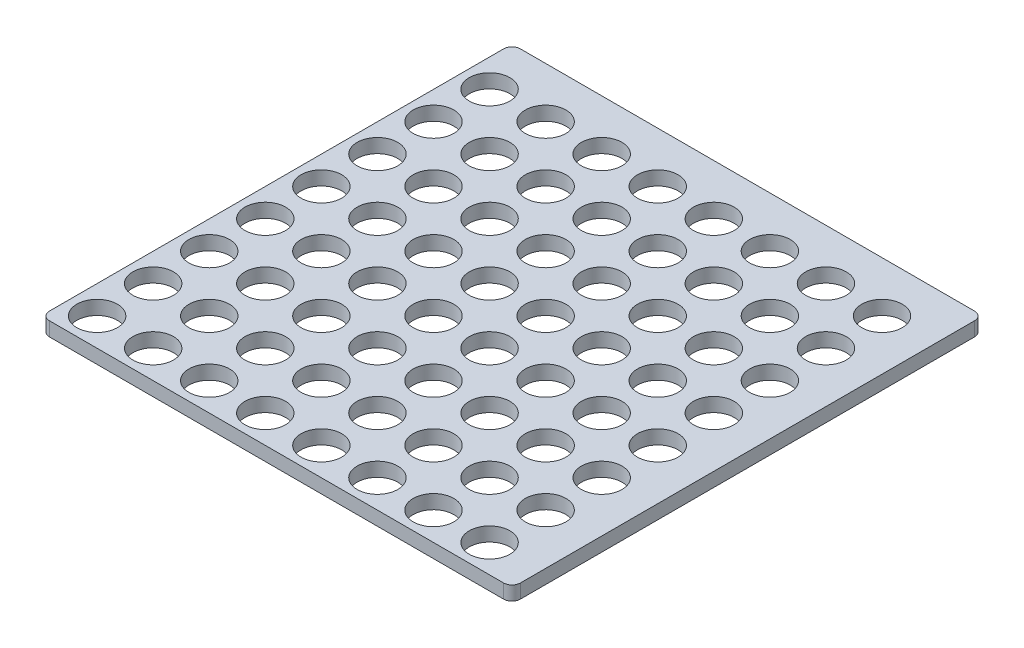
ISO-10303-21;
HEADER;
FILE_DESCRIPTION(('STEP AP214'),'2;1');
FILE_NAME('part.step','',(''),(''),'','','');
FILE_SCHEMA(('AUTOMOTIVE_DESIGN { 1 0 10303 214 1 1 1 1 }'));
ENDSEC;
DATA;
#1=APPLICATION_CONTEXT('core data for automotive mechanical design processes');
#2=APPLICATION_PROTOCOL_DEFINITION('international standard','automotive_design',2000,#1);
#3=PRODUCT_CONTEXT('',#1,'mechanical');
#4=PRODUCT('Part','Part','',(#3));
#5=PRODUCT_RELATED_PRODUCT_CATEGORY('part','',(#4));
#6=PRODUCT_DEFINITION_FORMATION('','',#4);
#7=PRODUCT_DEFINITION_CONTEXT('part definition',#1,'design');
#8=PRODUCT_DEFINITION('design','',#6,#7);
#9=PRODUCT_DEFINITION_SHAPE('','',#8);
#10=(LENGTH_UNIT() NAMED_UNIT(*) SI_UNIT(.MILLI.,.METRE.));
#11=(NAMED_UNIT(*) PLANE_ANGLE_UNIT() SI_UNIT($,.RADIAN.));
#12=(NAMED_UNIT(*) SI_UNIT($,.STERADIAN.) SOLID_ANGLE_UNIT());
#13=UNCERTAINTY_MEASURE_WITH_UNIT(LENGTH_MEASURE(1.E-05),#10,'distance_accuracy_value','');
#14=(GEOMETRIC_REPRESENTATION_CONTEXT(3) GLOBAL_UNCERTAINTY_ASSIGNED_CONTEXT((#13)) GLOBAL_UNIT_ASSIGNED_CONTEXT((#10,
#11,#12)) REPRESENTATION_CONTEXT('',''));
#15=CARTESIAN_POINT('',(0.,0.,0.));
#16=DIRECTION('',(0.,0.,1.));
#17=DIRECTION('',(1.,0.,0.));
#18=AXIS2_PLACEMENT_3D('',#15,#16,#17);
#19=CARTESIAN_POINT('',(84.,5.,84.));
#20=DIRECTION('',(-1.,0.,0.));
#21=DIRECTION('',(0.,0.,1.));
#22=AXIS2_PLACEMENT_3D('',#19,#20,#21);
#23=PLANE('',#22);
#24=DIRECTION('',(0.,0.,-1.));
#25=VECTOR('',#24,1.);
#26=CARTESIAN_POINT('',(84.,5.,84.));
#27=LINE('',#26,#25);
#28=CARTESIAN_POINT('',(84.,5.,81.));
#29=VERTEX_POINT('',#28);
#30=CARTESIAN_POINT('',(84.,5.,-80.9999999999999));
#31=VERTEX_POINT('',#30);
#32=EDGE_CURVE('E134',#29,#31,#27,.T.);
#33=ORIENTED_EDGE('',*,*,#32,.F.);
#34=DIRECTION('',(0.,-1.,0.));
#35=VECTOR('',#34,1.);
#36=CARTESIAN_POINT('',(84.,5.,81.));
#37=LINE('',#36,#35);
#38=CARTESIAN_POINT('',(84.,0.,81.));
#39=VERTEX_POINT('',#38);
#40=EDGE_CURVE('E11',#29,#39,#37,.T.);
#41=ORIENTED_EDGE('',*,*,#40,.T.);
#42=DIRECTION('',(0.,0.,-1.));
#43=VECTOR('',#42,1.);
#44=CARTESIAN_POINT('',(84.,0.,84.));
#45=LINE('',#44,#43);
#46=CARTESIAN_POINT('',(84.,0.,-80.9999999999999));
#47=VERTEX_POINT('',#46);
#48=EDGE_CURVE('E136',#39,#47,#45,.T.);
#49=ORIENTED_EDGE('',*,*,#48,.T.);
#50=DIRECTION('',(0.,-1.,0.));
#51=VECTOR('',#50,1.);
#52=CARTESIAN_POINT('',(84.,5.,-81.));
#53=LINE('',#52,#51);
#54=EDGE_CURVE('E47',#47,#31,#53,.F.);
#55=ORIENTED_EDGE('',*,*,#54,.T.);
#56=EDGE_LOOP('',(#33,#41,#49,#55));
#57=FACE_BOUND('',#56,.T.);
#58=ADVANCED_FACE('F39',(#57),#23,.F.);
#59=CARTESIAN_POINT('',(-84.,5.,-84.));
#60=DIRECTION('',(0.,0.,1.));
#61=DIRECTION('',(1.,0.,0.));
#62=AXIS2_PLACEMENT_3D('',#59,#60,#61);
#63=PLANE('',#62);
#64=DIRECTION('',(-1.,0.,0.));
#65=VECTOR('',#64,1.);
#66=CARTESIAN_POINT('',(-84.,0.,-84.));
#67=LINE('',#66,#65);
#68=CARTESIAN_POINT('',(80.9999999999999,0.,-84.));
#69=VERTEX_POINT('',#68);
#70=CARTESIAN_POINT('',(-81.,0.,-84.));
#71=VERTEX_POINT('',#70);
#72=EDGE_CURVE('E132',#69,#71,#67,.T.);
#73=ORIENTED_EDGE('',*,*,#72,.T.);
#74=DIRECTION('',(0.,-1.,0.));
#75=VECTOR('',#74,1.);
#76=CARTESIAN_POINT('',(-81.,5.,-84.));
#77=LINE('',#76,#75);
#78=CARTESIAN_POINT('',(-81.,5.,-84.));
#79=VERTEX_POINT('',#78);
#80=EDGE_CURVE('E111',#71,#79,#77,.F.);
#81=ORIENTED_EDGE('',*,*,#80,.T.);
#82=DIRECTION('',(-1.,0.,0.));
#83=VECTOR('',#82,1.);
#84=CARTESIAN_POINT('',(-84.,5.,-84.));
#85=LINE('',#84,#83);
#86=CARTESIAN_POINT('',(80.9999999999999,5.,-84.));
#87=VERTEX_POINT('',#86);
#88=EDGE_CURVE('E172',#87,#79,#85,.T.);
#89=ORIENTED_EDGE('',*,*,#88,.F.);
#90=DIRECTION('',(0.,-1.,0.));
#91=VECTOR('',#90,1.);
#92=CARTESIAN_POINT('',(81.,5.,-84.));
#93=LINE('',#92,#91);
#94=EDGE_CURVE('E116',#87,#69,#93,.T.);
#95=ORIENTED_EDGE('',*,*,#94,.T.);
#96=EDGE_LOOP('',(#73,#81,#89,#95));
#97=FACE_BOUND('',#96,.T.);
#98=ADVANCED_FACE('F176',(#97),#63,.F.);
#99=CARTESIAN_POINT('',(-84.,5.,84.));
#100=DIRECTION('',(1.,0.,0.));
#101=DIRECTION('',(0.,0.,-1.));
#102=AXIS2_PLACEMENT_3D('',#99,#100,#101);
#103=PLANE('',#102);
#104=DIRECTION('',(0.,0.,1.));
#105=VECTOR('',#104,1.);
#106=CARTESIAN_POINT('',(-84.,5.,84.));
#107=LINE('',#106,#105);
#108=CARTESIAN_POINT('',(-84.,5.,-80.9999999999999));
#109=VERTEX_POINT('',#108);
#110=CARTESIAN_POINT('',(-84.,5.,81.));
#111=VERTEX_POINT('',#110);
#112=EDGE_CURVE('E125',#109,#111,#107,.T.);
#113=ORIENTED_EDGE('',*,*,#112,.F.);
#114=DIRECTION('',(0.,-1.,0.));
#115=VECTOR('',#114,1.);
#116=CARTESIAN_POINT('',(-84.,5.,-81.));
#117=LINE('',#116,#115);
#118=CARTESIAN_POINT('',(-84.,0.,-80.9999999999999));
#119=VERTEX_POINT('',#118);
#120=EDGE_CURVE('E110',#109,#119,#117,.T.);
#121=ORIENTED_EDGE('',*,*,#120,.T.);
#122=DIRECTION('',(0.,0.,1.));
#123=VECTOR('',#122,1.);
#124=CARTESIAN_POINT('',(-84.,0.,84.));
#125=LINE('',#124,#123);
#126=CARTESIAN_POINT('',(-84.,0.,81.));
#127=VERTEX_POINT('',#126);
#128=EDGE_CURVE('E123',#119,#127,#125,.T.);
#129=ORIENTED_EDGE('',*,*,#128,.T.);
#130=DIRECTION('',(0.,-1.,0.));
#131=VECTOR('',#130,1.);
#132=CARTESIAN_POINT('',(-84.,5.,81.));
#133=LINE('',#132,#131);
#134=EDGE_CURVE('E127',#127,#111,#133,.F.);
#135=ORIENTED_EDGE('',*,*,#134,.T.);
#136=EDGE_LOOP('',(#113,#121,#129,#135));
#137=FACE_BOUND('',#136,.T.);
#138=ADVANCED_FACE('F122',(#137),#103,.F.);
#139=CARTESIAN_POINT('',(-84.,5.,84.));
#140=DIRECTION('',(0.,0.,-1.));
#141=DIRECTION('',(-1.,0.,0.));
#142=AXIS2_PLACEMENT_3D('',#139,#140,#141);
#143=PLANE('',#142);
#144=DIRECTION('',(1.,0.,0.));
#145=VECTOR('',#144,1.);
#146=CARTESIAN_POINT('',(-84.,5.,84.));
#147=LINE('',#146,#145);
#148=CARTESIAN_POINT('',(-81.,5.,84.));
#149=VERTEX_POINT('',#148);
#150=CARTESIAN_POINT('',(80.9999999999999,5.,84.));
#151=VERTEX_POINT('',#150);
#152=EDGE_CURVE('E140',#149,#151,#147,.T.);
#153=ORIENTED_EDGE('',*,*,#152,.F.);
#154=DIRECTION('',(0.,-1.,0.));
#155=VECTOR('',#154,1.);
#156=CARTESIAN_POINT('',(-81.,5.,84.));
#157=LINE('',#156,#155);
#158=CARTESIAN_POINT('',(-81.,0.,84.));
#159=VERTEX_POINT('',#158);
#160=EDGE_CURVE('E157',#149,#159,#157,.T.);
#161=ORIENTED_EDGE('',*,*,#160,.T.);
#162=DIRECTION('',(1.,0.,0.));
#163=VECTOR('',#162,1.);
#164=CARTESIAN_POINT('',(-84.,0.,84.));
#165=LINE('',#164,#163);
#166=CARTESIAN_POINT('',(80.9999999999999,0.,84.));
#167=VERTEX_POINT('',#166);
#168=EDGE_CURVE('E131',#159,#167,#165,.T.);
#169=ORIENTED_EDGE('',*,*,#168,.T.);
#170=DIRECTION('',(0.,-1.,0.));
#171=VECTOR('',#170,1.);
#172=CARTESIAN_POINT('',(81.,5.,84.));
#173=LINE('',#172,#171);
#174=EDGE_CURVE('E54',#167,#151,#173,.F.);
#175=ORIENTED_EDGE('',*,*,#174,.T.);
#176=EDGE_LOOP('',(#153,#161,#169,#175));
#177=FACE_BOUND('',#176,.T.);
#178=ADVANCED_FACE('F841',(#177),#143,.F.);
#179=CARTESIAN_POINT('',(0.,5.,0.));
#180=DIRECTION('',(0.,-1.,0.));
#181=DIRECTION('',(0.,0.,-1.));
#182=AXIS2_PLACEMENT_3D('',#179,#180,#181);
#183=PLANE('',#182);
#184=CARTESIAN_POINT('',(65.9999999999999,5.,74.0024968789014));
#185=DIRECTION('',(0.,-1.,0.));
#186=DIRECTION('',(0.,0.,-1.));
#187=AXIS2_PLACEMENT_3D('',#184,#185,#186);
#188=CIRCLE('',#187,7.25000000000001);
#189=CARTESIAN_POINT('',(65.9999999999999,5.,66.7524968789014));
#190=VERTEX_POINT('',#189);
#191=EDGE_CURVE('E559',#190,#190,#188,.T.);
#192=ORIENTED_EDGE('',*,*,#191,.T.);
#193=EDGE_LOOP('',(#192));
#194=FACE_BOUND('',#193,.T.);
#195=CARTESIAN_POINT('',(45.9999999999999,5.,74.0024968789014));
#196=DIRECTION('',(0.,-1.,0.));
#197=DIRECTION('',(0.,0.,-1.));
#198=AXIS2_PLACEMENT_3D('',#195,#196,#197);
#199=CIRCLE('',#198,7.25);
#200=CARTESIAN_POINT('',(45.9999999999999,5.,66.7524968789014));
#201=VERTEX_POINT('',#200);
#202=EDGE_CURVE('E553',#201,#201,#199,.T.);
#203=ORIENTED_EDGE('',*,*,#202,.T.);
#204=EDGE_LOOP('',(#203));
#205=FACE_BOUND('',#204,.T.);
#206=CARTESIAN_POINT('',(25.9999999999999,5.,74.0024968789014));
#207=DIRECTION('',(0.,-1.,0.));
#208=DIRECTION('',(0.,0.,-1.));
#209=AXIS2_PLACEMENT_3D('',#206,#207,#208);
#210=CIRCLE('',#209,7.25);
#211=CARTESIAN_POINT('',(25.9999999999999,5.,66.7524968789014));
#212=VERTEX_POINT('',#211);
#213=EDGE_CURVE('E547',#212,#212,#210,.T.);
#214=ORIENTED_EDGE('',*,*,#213,.T.);
#215=EDGE_LOOP('',(#214));
#216=FACE_BOUND('',#215,.T.);
#217=CARTESIAN_POINT('',(5.99999999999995,5.,74.0024968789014));
#218=DIRECTION('',(0.,-1.,0.));
#219=DIRECTION('',(0.,0.,-1.));
#220=AXIS2_PLACEMENT_3D('',#217,#218,#219);
#221=CIRCLE('',#220,7.25);
#222=CARTESIAN_POINT('',(5.99999999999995,5.,66.7524968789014));
#223=VERTEX_POINT('',#222);
#224=EDGE_CURVE('E541',#223,#223,#221,.T.);
#225=ORIENTED_EDGE('',*,*,#224,.T.);
#226=EDGE_LOOP('',(#225));
#227=FACE_BOUND('',#226,.T.);
#228=CARTESIAN_POINT('',(-14.,5.,74.0024968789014));
#229=DIRECTION('',(0.,-1.,0.));
#230=DIRECTION('',(0.,0.,-1.));
#231=AXIS2_PLACEMENT_3D('',#228,#229,#230);
#232=CIRCLE('',#231,7.25);
#233=CARTESIAN_POINT('',(-14.,5.,66.7524968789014));
#234=VERTEX_POINT('',#233);
#235=EDGE_CURVE('E535',#234,#234,#232,.T.);
#236=ORIENTED_EDGE('',*,*,#235,.T.);
#237=EDGE_LOOP('',(#236));
#238=FACE_BOUND('',#237,.T.);
#239=CARTESIAN_POINT('',(-34.,5.,74.0024968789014));
#240=DIRECTION('',(0.,-1.,0.));
#241=DIRECTION('',(0.,0.,-1.));
#242=AXIS2_PLACEMENT_3D('',#239,#240,#241);
#243=CIRCLE('',#242,7.25);
#244=CARTESIAN_POINT('',(-34.,5.,66.7524968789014));
#245=VERTEX_POINT('',#244);
#246=EDGE_CURVE('E529',#245,#245,#243,.T.);
#247=ORIENTED_EDGE('',*,*,#246,.T.);
#248=EDGE_LOOP('',(#247));
#249=FACE_BOUND('',#248,.T.);
#250=CARTESIAN_POINT('',(-54.,5.,74.0024968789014));
#251=DIRECTION('',(0.,-1.,0.));
#252=DIRECTION('',(0.,0.,-1.));
#253=AXIS2_PLACEMENT_3D('',#250,#251,#252);
#254=CIRCLE('',#253,7.25);
#255=CARTESIAN_POINT('',(-54.,5.,66.7524968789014));
#256=VERTEX_POINT('',#255);
#257=EDGE_CURVE('E523',#256,#256,#254,.T.);
#258=ORIENTED_EDGE('',*,*,#257,.T.);
#259=EDGE_LOOP('',(#258));
#260=FACE_BOUND('',#259,.T.);
#261=CARTESIAN_POINT('',(-74.,5.,74.0024968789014));
#262=DIRECTION('',(0.,-1.,0.));
#263=DIRECTION('',(0.,0.,-1.));
#264=AXIS2_PLACEMENT_3D('',#261,#262,#263);
#265=CIRCLE('',#264,7.25000000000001);
#266=CARTESIAN_POINT('',(-74.,5.,66.7524968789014));
#267=VERTEX_POINT('',#266);
#268=EDGE_CURVE('E517',#267,#267,#265,.T.);
#269=ORIENTED_EDGE('',*,*,#268,.T.);
#270=EDGE_LOOP('',(#269));
#271=FACE_BOUND('',#270,.T.);
#272=CARTESIAN_POINT('',(65.9999999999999,5.,54.0024968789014));
#273=DIRECTION('',(0.,-1.,0.));
#274=DIRECTION('',(0.,0.,-1.));
#275=AXIS2_PLACEMENT_3D('',#272,#273,#274);
#276=CIRCLE('',#275,7.25000000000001);
#277=CARTESIAN_POINT('',(65.9999999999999,5.,46.7524968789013));
#278=VERTEX_POINT('',#277);
#279=EDGE_CURVE('E511',#278,#278,#276,.T.);
#280=ORIENTED_EDGE('',*,*,#279,.T.);
#281=EDGE_LOOP('',(#280));
#282=FACE_BOUND('',#281,.T.);
#283=CARTESIAN_POINT('',(45.9999999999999,5.,54.0024968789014));
#284=DIRECTION('',(0.,-1.,0.));
#285=DIRECTION('',(0.,0.,-1.));
#286=AXIS2_PLACEMENT_3D('',#283,#284,#285);
#287=CIRCLE('',#286,7.25);
#288=CARTESIAN_POINT('',(45.9999999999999,5.,46.7524968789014));
#289=VERTEX_POINT('',#288);
#290=EDGE_CURVE('E505',#289,#289,#287,.T.);
#291=ORIENTED_EDGE('',*,*,#290,.T.);
#292=EDGE_LOOP('',(#291));
#293=FACE_BOUND('',#292,.T.);
#294=CARTESIAN_POINT('',(25.9999999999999,5.,54.0024968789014));
#295=DIRECTION('',(0.,-1.,0.));
#296=DIRECTION('',(0.,0.,-1.));
#297=AXIS2_PLACEMENT_3D('',#294,#295,#296);
#298=CIRCLE('',#297,7.25);
#299=CARTESIAN_POINT('',(25.9999999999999,5.,46.7524968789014));
#300=VERTEX_POINT('',#299);
#301=EDGE_CURVE('E499',#300,#300,#298,.T.);
#302=ORIENTED_EDGE('',*,*,#301,.T.);
#303=EDGE_LOOP('',(#302));
#304=FACE_BOUND('',#303,.T.);
#305=CARTESIAN_POINT('',(5.99999999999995,5.,54.0024968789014));
#306=DIRECTION('',(0.,-1.,0.));
#307=DIRECTION('',(0.,0.,-1.));
#308=AXIS2_PLACEMENT_3D('',#305,#306,#307);
#309=CIRCLE('',#308,7.25);
#310=CARTESIAN_POINT('',(5.99999999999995,5.,46.7524968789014));
#311=VERTEX_POINT('',#310);
#312=EDGE_CURVE('E493',#311,#311,#309,.T.);
#313=ORIENTED_EDGE('',*,*,#312,.T.);
#314=EDGE_LOOP('',(#313));
#315=FACE_BOUND('',#314,.T.);
#316=CARTESIAN_POINT('',(-14.,5.,54.0024968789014));
#317=DIRECTION('',(0.,-1.,0.));
#318=DIRECTION('',(0.,0.,-1.));
#319=AXIS2_PLACEMENT_3D('',#316,#317,#318);
#320=CIRCLE('',#319,7.25);
#321=CARTESIAN_POINT('',(-14.,5.,46.7524968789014));
#322=VERTEX_POINT('',#321);
#323=EDGE_CURVE('E487',#322,#322,#320,.T.);
#324=ORIENTED_EDGE('',*,*,#323,.T.);
#325=EDGE_LOOP('',(#324));
#326=FACE_BOUND('',#325,.T.);
#327=CARTESIAN_POINT('',(-34.,5.,54.0024968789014));
#328=DIRECTION('',(0.,-1.,0.));
#329=DIRECTION('',(0.,0.,-1.));
#330=AXIS2_PLACEMENT_3D('',#327,#328,#329);
#331=CIRCLE('',#330,7.25);
#332=CARTESIAN_POINT('',(-34.,5.,46.7524968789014));
#333=VERTEX_POINT('',#332);
#334=EDGE_CURVE('E481',#333,#333,#331,.T.);
#335=ORIENTED_EDGE('',*,*,#334,.T.);
#336=EDGE_LOOP('',(#335));
#337=FACE_BOUND('',#336,.T.);
#338=CARTESIAN_POINT('',(-54.,5.,54.0024968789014));
#339=DIRECTION('',(0.,-1.,0.));
#340=DIRECTION('',(0.,0.,-1.));
#341=AXIS2_PLACEMENT_3D('',#338,#339,#340);
#342=CIRCLE('',#341,7.25);
#343=CARTESIAN_POINT('',(-54.,5.,46.7524968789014));
#344=VERTEX_POINT('',#343);
#345=EDGE_CURVE('E475',#344,#344,#342,.T.);
#346=ORIENTED_EDGE('',*,*,#345,.T.);
#347=EDGE_LOOP('',(#346));
#348=FACE_BOUND('',#347,.T.);
#349=CARTESIAN_POINT('',(-74.,5.,54.0024968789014));
#350=DIRECTION('',(0.,-1.,0.));
#351=DIRECTION('',(0.,0.,-1.));
#352=AXIS2_PLACEMENT_3D('',#349,#350,#351);
#353=CIRCLE('',#352,7.25000000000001);
#354=CARTESIAN_POINT('',(-74.,5.,46.7524968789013));
#355=VERTEX_POINT('',#354);
#356=EDGE_CURVE('E469',#355,#355,#353,.T.);
#357=ORIENTED_EDGE('',*,*,#356,.T.);
#358=EDGE_LOOP('',(#357));
#359=FACE_BOUND('',#358,.T.);
#360=CARTESIAN_POINT('',(65.9999999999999,5.,34.0024968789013));
#361=DIRECTION('',(0.,-1.,0.));
#362=DIRECTION('',(0.,0.,-1.));
#363=AXIS2_PLACEMENT_3D('',#360,#361,#362);
#364=CIRCLE('',#363,7.25000000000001);
#365=CARTESIAN_POINT('',(65.9999999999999,5.,26.7524968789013));
#366=VERTEX_POINT('',#365);
#367=EDGE_CURVE('E463',#366,#366,#364,.T.);
#368=ORIENTED_EDGE('',*,*,#367,.T.);
#369=EDGE_LOOP('',(#368));
#370=FACE_BOUND('',#369,.T.);
#371=CARTESIAN_POINT('',(45.9999999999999,5.,34.0024968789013));
#372=DIRECTION('',(0.,-1.,0.));
#373=DIRECTION('',(0.,0.,-1.));
#374=AXIS2_PLACEMENT_3D('',#371,#372,#373);
#375=CIRCLE('',#374,7.25);
#376=CARTESIAN_POINT('',(45.9999999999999,5.,26.7524968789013));
#377=VERTEX_POINT('',#376);
#378=EDGE_CURVE('E457',#377,#377,#375,.T.);
#379=ORIENTED_EDGE('',*,*,#378,.T.);
#380=EDGE_LOOP('',(#379));
#381=FACE_BOUND('',#380,.T.);
#382=CARTESIAN_POINT('',(25.9999999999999,5.,34.0024968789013));
#383=DIRECTION('',(0.,-1.,0.));
#384=DIRECTION('',(0.,0.,-1.));
#385=AXIS2_PLACEMENT_3D('',#382,#383,#384);
#386=CIRCLE('',#385,7.25);
#387=CARTESIAN_POINT('',(25.9999999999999,5.,26.7524968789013));
#388=VERTEX_POINT('',#387);
#389=EDGE_CURVE('E451',#388,#388,#386,.T.);
#390=ORIENTED_EDGE('',*,*,#389,.T.);
#391=EDGE_LOOP('',(#390));
#392=FACE_BOUND('',#391,.T.);
#393=CARTESIAN_POINT('',(5.99999999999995,5.,34.0024968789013));
#394=DIRECTION('',(0.,-1.,0.));
#395=DIRECTION('',(0.,0.,-1.));
#396=AXIS2_PLACEMENT_3D('',#393,#394,#395);
#397=CIRCLE('',#396,7.25);
#398=CARTESIAN_POINT('',(5.99999999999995,5.,26.7524968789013));
#399=VERTEX_POINT('',#398);
#400=EDGE_CURVE('E445',#399,#399,#397,.T.);
#401=ORIENTED_EDGE('',*,*,#400,.T.);
#402=EDGE_LOOP('',(#401));
#403=FACE_BOUND('',#402,.T.);
#404=CARTESIAN_POINT('',(-14.,5.,34.0024968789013));
#405=DIRECTION('',(0.,-1.,0.));
#406=DIRECTION('',(0.,0.,-1.));
#407=AXIS2_PLACEMENT_3D('',#404,#405,#406);
#408=CIRCLE('',#407,7.25);
#409=CARTESIAN_POINT('',(-14.,5.,26.7524968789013));
#410=VERTEX_POINT('',#409);
#411=EDGE_CURVE('E439',#410,#410,#408,.T.);
#412=ORIENTED_EDGE('',*,*,#411,.T.);
#413=EDGE_LOOP('',(#412));
#414=FACE_BOUND('',#413,.T.);
#415=CARTESIAN_POINT('',(-34.,5.,34.0024968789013));
#416=DIRECTION('',(0.,-1.,0.));
#417=DIRECTION('',(0.,0.,-1.));
#418=AXIS2_PLACEMENT_3D('',#415,#416,#417);
#419=CIRCLE('',#418,7.25);
#420=CARTESIAN_POINT('',(-34.,5.,26.7524968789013));
#421=VERTEX_POINT('',#420);
#422=EDGE_CURVE('E433',#421,#421,#419,.T.);
#423=ORIENTED_EDGE('',*,*,#422,.T.);
#424=EDGE_LOOP('',(#423));
#425=FACE_BOUND('',#424,.T.);
#426=CARTESIAN_POINT('',(-54.,5.,34.0024968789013));
#427=DIRECTION('',(0.,-1.,0.));
#428=DIRECTION('',(0.,0.,-1.));
#429=AXIS2_PLACEMENT_3D('',#426,#427,#428);
#430=CIRCLE('',#429,7.25);
#431=CARTESIAN_POINT('',(-54.,5.,26.7524968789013));
#432=VERTEX_POINT('',#431);
#433=EDGE_CURVE('E427',#432,#432,#430,.T.);
#434=ORIENTED_EDGE('',*,*,#433,.T.);
#435=EDGE_LOOP('',(#434));
#436=FACE_BOUND('',#435,.T.);
#437=CARTESIAN_POINT('',(-74.,5.,34.0024968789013));
#438=DIRECTION('',(0.,-1.,0.));
#439=DIRECTION('',(0.,0.,-1.));
#440=AXIS2_PLACEMENT_3D('',#437,#438,#439);
#441=CIRCLE('',#440,7.25000000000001);
#442=CARTESIAN_POINT('',(-74.,5.,26.7524968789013));
#443=VERTEX_POINT('',#442);
#444=EDGE_CURVE('E421',#443,#443,#441,.T.);
#445=ORIENTED_EDGE('',*,*,#444,.T.);
#446=EDGE_LOOP('',(#445));
#447=FACE_BOUND('',#446,.T.);
#448=CARTESIAN_POINT('',(65.9999999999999,5.,14.0024968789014));
#449=DIRECTION('',(0.,-1.,0.));
#450=DIRECTION('',(0.,0.,-1.));
#451=AXIS2_PLACEMENT_3D('',#448,#449,#450);
#452=CIRCLE('',#451,7.25000000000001);
#453=CARTESIAN_POINT('',(65.9999999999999,5.,6.75249687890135));
#454=VERTEX_POINT('',#453);
#455=EDGE_CURVE('E415',#454,#454,#452,.T.);
#456=ORIENTED_EDGE('',*,*,#455,.T.);
#457=EDGE_LOOP('',(#456));
#458=FACE_BOUND('',#457,.T.);
#459=CARTESIAN_POINT('',(45.9999999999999,5.,14.0024968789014));
#460=DIRECTION('',(0.,-1.,0.));
#461=DIRECTION('',(0.,0.,-1.));
#462=AXIS2_PLACEMENT_3D('',#459,#460,#461);
#463=CIRCLE('',#462,7.25);
#464=CARTESIAN_POINT('',(45.9999999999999,5.,6.75249687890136));
#465=VERTEX_POINT('',#464);
#466=EDGE_CURVE('E409',#465,#465,#463,.T.);
#467=ORIENTED_EDGE('',*,*,#466,.T.);
#468=EDGE_LOOP('',(#467));
#469=FACE_BOUND('',#468,.T.);
#470=CARTESIAN_POINT('',(25.9999999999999,5.,14.0024968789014));
#471=DIRECTION('',(0.,-1.,0.));
#472=DIRECTION('',(0.,0.,-1.));
#473=AXIS2_PLACEMENT_3D('',#470,#471,#472);
#474=CIRCLE('',#473,7.25);
#475=CARTESIAN_POINT('',(25.9999999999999,5.,6.75249687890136));
#476=VERTEX_POINT('',#475);
#477=EDGE_CURVE('E403',#476,#476,#474,.T.);
#478=ORIENTED_EDGE('',*,*,#477,.T.);
#479=EDGE_LOOP('',(#478));
#480=FACE_BOUND('',#479,.T.);
#481=CARTESIAN_POINT('',(5.99999999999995,5.,14.0024968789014));
#482=DIRECTION('',(0.,-1.,0.));
#483=DIRECTION('',(0.,0.,-1.));
#484=AXIS2_PLACEMENT_3D('',#481,#482,#483);
#485=CIRCLE('',#484,7.25);
#486=CARTESIAN_POINT('',(5.99999999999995,5.,6.75249687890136));
#487=VERTEX_POINT('',#486);
#488=EDGE_CURVE('E397',#487,#487,#485,.T.);
#489=ORIENTED_EDGE('',*,*,#488,.T.);
#490=EDGE_LOOP('',(#489));
#491=FACE_BOUND('',#490,.T.);
#492=CARTESIAN_POINT('',(-14.,5.,14.0024968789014));
#493=DIRECTION('',(0.,-1.,0.));
#494=DIRECTION('',(0.,0.,-1.));
#495=AXIS2_PLACEMENT_3D('',#492,#493,#494);
#496=CIRCLE('',#495,7.25);
#497=CARTESIAN_POINT('',(-14.,5.,6.75249687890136));
#498=VERTEX_POINT('',#497);
#499=EDGE_CURVE('E391',#498,#498,#496,.T.);
#500=ORIENTED_EDGE('',*,*,#499,.T.);
#501=EDGE_LOOP('',(#500));
#502=FACE_BOUND('',#501,.T.);
#503=CARTESIAN_POINT('',(-34.,5.,14.0024968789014));
#504=DIRECTION('',(0.,-1.,0.));
#505=DIRECTION('',(0.,0.,-1.));
#506=AXIS2_PLACEMENT_3D('',#503,#504,#505);
#507=CIRCLE('',#506,7.25);
#508=CARTESIAN_POINT('',(-34.,5.,6.75249687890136));
#509=VERTEX_POINT('',#508);
#510=EDGE_CURVE('E385',#509,#509,#507,.T.);
#511=ORIENTED_EDGE('',*,*,#510,.T.);
#512=EDGE_LOOP('',(#511));
#513=FACE_BOUND('',#512,.T.);
#514=CARTESIAN_POINT('',(-54.,5.,14.0024968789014));
#515=DIRECTION('',(0.,-1.,0.));
#516=DIRECTION('',(0.,0.,-1.));
#517=AXIS2_PLACEMENT_3D('',#514,#515,#516);
#518=CIRCLE('',#517,7.25);
#519=CARTESIAN_POINT('',(-54.,5.,6.75249687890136));
#520=VERTEX_POINT('',#519);
#521=EDGE_CURVE('E379',#520,#520,#518,.T.);
#522=ORIENTED_EDGE('',*,*,#521,.T.);
#523=EDGE_LOOP('',(#522));
#524=FACE_BOUND('',#523,.T.);
#525=CARTESIAN_POINT('',(-74.,5.,14.0024968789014));
#526=DIRECTION('',(0.,-1.,0.));
#527=DIRECTION('',(0.,0.,-1.));
#528=AXIS2_PLACEMENT_3D('',#525,#526,#527);
#529=CIRCLE('',#528,7.25000000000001);
#530=CARTESIAN_POINT('',(-74.,5.,6.75249687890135));
#531=VERTEX_POINT('',#530);
#532=EDGE_CURVE('E373',#531,#531,#529,.T.);
#533=ORIENTED_EDGE('',*,*,#532,.T.);
#534=EDGE_LOOP('',(#533));
#535=FACE_BOUND('',#534,.T.);
#536=CARTESIAN_POINT('',(65.9999999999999,5.,-5.99750312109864));
#537=DIRECTION('',(0.,-1.,0.));
#538=DIRECTION('',(0.,0.,-1.));
#539=AXIS2_PLACEMENT_3D('',#536,#537,#538);
#540=CIRCLE('',#539,7.25000000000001);
#541=CARTESIAN_POINT('',(65.9999999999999,5.,-13.2475031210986));
#542=VERTEX_POINT('',#541);
#543=EDGE_CURVE('E367',#542,#542,#540,.T.);
#544=ORIENTED_EDGE('',*,*,#543,.T.);
#545=EDGE_LOOP('',(#544));
#546=FACE_BOUND('',#545,.T.);
#547=CARTESIAN_POINT('',(45.9999999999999,5.,-5.99750312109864));
#548=DIRECTION('',(0.,-1.,0.));
#549=DIRECTION('',(0.,0.,-1.));
#550=AXIS2_PLACEMENT_3D('',#547,#548,#549);
#551=CIRCLE('',#550,7.25);
#552=CARTESIAN_POINT('',(45.9999999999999,5.,-13.2475031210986));
#553=VERTEX_POINT('',#552);
#554=EDGE_CURVE('E361',#553,#553,#551,.T.);
#555=ORIENTED_EDGE('',*,*,#554,.T.);
#556=EDGE_LOOP('',(#555));
#557=FACE_BOUND('',#556,.T.);
#558=CARTESIAN_POINT('',(25.9999999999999,5.,-5.99750312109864));
#559=DIRECTION('',(0.,-1.,0.));
#560=DIRECTION('',(0.,0.,-1.));
#561=AXIS2_PLACEMENT_3D('',#558,#559,#560);
#562=CIRCLE('',#561,7.25);
#563=CARTESIAN_POINT('',(25.9999999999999,5.,-13.2475031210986));
#564=VERTEX_POINT('',#563);
#565=EDGE_CURVE('E355',#564,#564,#562,.T.);
#566=ORIENTED_EDGE('',*,*,#565,.T.);
#567=EDGE_LOOP('',(#566));
#568=FACE_BOUND('',#567,.T.);
#569=CARTESIAN_POINT('',(5.99999999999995,5.,-5.99750312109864));
#570=DIRECTION('',(0.,-1.,0.));
#571=DIRECTION('',(0.,0.,-1.));
#572=AXIS2_PLACEMENT_3D('',#569,#570,#571);
#573=CIRCLE('',#572,7.25);
#574=CARTESIAN_POINT('',(5.99999999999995,5.,-13.2475031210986));
#575=VERTEX_POINT('',#574);
#576=EDGE_CURVE('E349',#575,#575,#573,.T.);
#577=ORIENTED_EDGE('',*,*,#576,.T.);
#578=EDGE_LOOP('',(#577));
#579=FACE_BOUND('',#578,.T.);
#580=CARTESIAN_POINT('',(-14.,5.,-5.99750312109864));
#581=DIRECTION('',(0.,-1.,0.));
#582=DIRECTION('',(0.,0.,-1.));
#583=AXIS2_PLACEMENT_3D('',#580,#581,#582);
#584=CIRCLE('',#583,7.25);
#585=CARTESIAN_POINT('',(-14.,5.,-13.2475031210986));
#586=VERTEX_POINT('',#585);
#587=EDGE_CURVE('E343',#586,#586,#584,.T.);
#588=ORIENTED_EDGE('',*,*,#587,.T.);
#589=EDGE_LOOP('',(#588));
#590=FACE_BOUND('',#589,.T.);
#591=CARTESIAN_POINT('',(-34.,5.,-5.99750312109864));
#592=DIRECTION('',(0.,-1.,0.));
#593=DIRECTION('',(0.,0.,-1.));
#594=AXIS2_PLACEMENT_3D('',#591,#592,#593);
#595=CIRCLE('',#594,7.25);
#596=CARTESIAN_POINT('',(-34.,5.,-13.2475031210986));
#597=VERTEX_POINT('',#596);
#598=EDGE_CURVE('E337',#597,#597,#595,.T.);
#599=ORIENTED_EDGE('',*,*,#598,.T.);
#600=EDGE_LOOP('',(#599));
#601=FACE_BOUND('',#600,.T.);
#602=CARTESIAN_POINT('',(-54.,5.,-5.99750312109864));
#603=DIRECTION('',(0.,-1.,0.));
#604=DIRECTION('',(0.,0.,-1.));
#605=AXIS2_PLACEMENT_3D('',#602,#603,#604);
#606=CIRCLE('',#605,7.25);
#607=CARTESIAN_POINT('',(-54.,5.,-13.2475031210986));
#608=VERTEX_POINT('',#607);
#609=EDGE_CURVE('E331',#608,#608,#606,.T.);
#610=ORIENTED_EDGE('',*,*,#609,.T.);
#611=EDGE_LOOP('',(#610));
#612=FACE_BOUND('',#611,.T.);
#613=CARTESIAN_POINT('',(-74.,5.,-5.99750312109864));
#614=DIRECTION('',(0.,-1.,0.));
#615=DIRECTION('',(0.,0.,-1.));
#616=AXIS2_PLACEMENT_3D('',#613,#614,#615);
#617=CIRCLE('',#616,7.25000000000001);
#618=CARTESIAN_POINT('',(-74.,5.,-13.2475031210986));
#619=VERTEX_POINT('',#618);
#620=EDGE_CURVE('E325',#619,#619,#617,.T.);
#621=ORIENTED_EDGE('',*,*,#620,.T.);
#622=EDGE_LOOP('',(#621));
#623=FACE_BOUND('',#622,.T.);
#624=CARTESIAN_POINT('',(65.9999999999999,5.,-25.9975031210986));
#625=DIRECTION('',(0.,-1.,0.));
#626=DIRECTION('',(0.,0.,-1.));
#627=AXIS2_PLACEMENT_3D('',#624,#625,#626);
#628=CIRCLE('',#627,7.25000000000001);
#629=CARTESIAN_POINT('',(65.9999999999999,5.,-33.2475031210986));
#630=VERTEX_POINT('',#629);
#631=EDGE_CURVE('E319',#630,#630,#628,.T.);
#632=ORIENTED_EDGE('',*,*,#631,.T.);
#633=EDGE_LOOP('',(#632));
#634=FACE_BOUND('',#633,.T.);
#635=CARTESIAN_POINT('',(45.9999999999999,5.,-25.9975031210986));
#636=DIRECTION('',(0.,-1.,0.));
#637=DIRECTION('',(0.,0.,-1.));
#638=AXIS2_PLACEMENT_3D('',#635,#636,#637);
#639=CIRCLE('',#638,7.25);
#640=CARTESIAN_POINT('',(45.9999999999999,5.,-33.2475031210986));
#641=VERTEX_POINT('',#640);
#642=EDGE_CURVE('E313',#641,#641,#639,.T.);
#643=ORIENTED_EDGE('',*,*,#642,.T.);
#644=EDGE_LOOP('',(#643));
#645=FACE_BOUND('',#644,.T.);
#646=CARTESIAN_POINT('',(25.9999999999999,5.,-25.9975031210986));
#647=DIRECTION('',(0.,-1.,0.));
#648=DIRECTION('',(0.,0.,-1.));
#649=AXIS2_PLACEMENT_3D('',#646,#647,#648);
#650=CIRCLE('',#649,7.25);
#651=CARTESIAN_POINT('',(25.9999999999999,5.,-33.2475031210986));
#652=VERTEX_POINT('',#651);
#653=EDGE_CURVE('E307',#652,#652,#650,.T.);
#654=ORIENTED_EDGE('',*,*,#653,.T.);
#655=EDGE_LOOP('',(#654));
#656=FACE_BOUND('',#655,.T.);
#657=CARTESIAN_POINT('',(5.99999999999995,5.,-25.9975031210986));
#658=DIRECTION('',(0.,-1.,0.));
#659=DIRECTION('',(0.,0.,-1.));
#660=AXIS2_PLACEMENT_3D('',#657,#658,#659);
#661=CIRCLE('',#660,7.25);
#662=CARTESIAN_POINT('',(5.99999999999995,5.,-33.2475031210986));
#663=VERTEX_POINT('',#662);
#664=EDGE_CURVE('E301',#663,#663,#661,.T.);
#665=ORIENTED_EDGE('',*,*,#664,.T.);
#666=EDGE_LOOP('',(#665));
#667=FACE_BOUND('',#666,.T.);
#668=CARTESIAN_POINT('',(-14.,5.,-25.9975031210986));
#669=DIRECTION('',(0.,-1.,0.));
#670=DIRECTION('',(0.,0.,-1.));
#671=AXIS2_PLACEMENT_3D('',#668,#669,#670);
#672=CIRCLE('',#671,7.25);
#673=CARTESIAN_POINT('',(-14.,5.,-33.2475031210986));
#674=VERTEX_POINT('',#673);
#675=EDGE_CURVE('E295',#674,#674,#672,.T.);
#676=ORIENTED_EDGE('',*,*,#675,.T.);
#677=EDGE_LOOP('',(#676));
#678=FACE_BOUND('',#677,.T.);
#679=CARTESIAN_POINT('',(-34.,5.,-25.9975031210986));
#680=DIRECTION('',(0.,-1.,0.));
#681=DIRECTION('',(0.,0.,-1.));
#682=AXIS2_PLACEMENT_3D('',#679,#680,#681);
#683=CIRCLE('',#682,7.25);
#684=CARTESIAN_POINT('',(-34.,5.,-33.2475031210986));
#685=VERTEX_POINT('',#684);
#686=EDGE_CURVE('E289',#685,#685,#683,.T.);
#687=ORIENTED_EDGE('',*,*,#686,.T.);
#688=EDGE_LOOP('',(#687));
#689=FACE_BOUND('',#688,.T.);
#690=CARTESIAN_POINT('',(-54.,5.,-25.9975031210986));
#691=DIRECTION('',(0.,-1.,0.));
#692=DIRECTION('',(0.,0.,-1.));
#693=AXIS2_PLACEMENT_3D('',#690,#691,#692);
#694=CIRCLE('',#693,7.25);
#695=CARTESIAN_POINT('',(-54.,5.,-33.2475031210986));
#696=VERTEX_POINT('',#695);
#697=EDGE_CURVE('E283',#696,#696,#694,.T.);
#698=ORIENTED_EDGE('',*,*,#697,.T.);
#699=EDGE_LOOP('',(#698));
#700=FACE_BOUND('',#699,.T.);
#701=CARTESIAN_POINT('',(-74.,5.,-25.9975031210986));
#702=DIRECTION('',(0.,-1.,0.));
#703=DIRECTION('',(0.,0.,-1.));
#704=AXIS2_PLACEMENT_3D('',#701,#702,#703);
#705=CIRCLE('',#704,7.25000000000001);
#706=CARTESIAN_POINT('',(-74.,5.,-33.2475031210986));
#707=VERTEX_POINT('',#706);
#708=EDGE_CURVE('E277',#707,#707,#705,.T.);
#709=ORIENTED_EDGE('',*,*,#708,.T.);
#710=EDGE_LOOP('',(#709));
#711=FACE_BOUND('',#710,.T.);
#712=CARTESIAN_POINT('',(65.9999999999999,5.,-45.9975031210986));
#713=DIRECTION('',(0.,-1.,0.));
#714=DIRECTION('',(0.,0.,-1.));
#715=AXIS2_PLACEMENT_3D('',#712,#713,#714);
#716=CIRCLE('',#715,7.25000000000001);
#717=CARTESIAN_POINT('',(65.9999999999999,5.,-53.2475031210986));
#718=VERTEX_POINT('',#717);
#719=EDGE_CURVE('E271',#718,#718,#716,.T.);
#720=ORIENTED_EDGE('',*,*,#719,.T.);
#721=EDGE_LOOP('',(#720));
#722=FACE_BOUND('',#721,.T.);
#723=CARTESIAN_POINT('',(45.9999999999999,5.,-45.9975031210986));
#724=DIRECTION('',(0.,-1.,0.));
#725=DIRECTION('',(0.,0.,-1.));
#726=AXIS2_PLACEMENT_3D('',#723,#724,#725);
#727=CIRCLE('',#726,7.25);
#728=CARTESIAN_POINT('',(45.9999999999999,5.,-53.2475031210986));
#729=VERTEX_POINT('',#728);
#730=EDGE_CURVE('E265',#729,#729,#727,.T.);
#731=ORIENTED_EDGE('',*,*,#730,.T.);
#732=EDGE_LOOP('',(#731));
#733=FACE_BOUND('',#732,.T.);
#734=CARTESIAN_POINT('',(25.9999999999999,5.,-45.9975031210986));
#735=DIRECTION('',(0.,-1.,0.));
#736=DIRECTION('',(0.,0.,-1.));
#737=AXIS2_PLACEMENT_3D('',#734,#735,#736);
#738=CIRCLE('',#737,7.25);
#739=CARTESIAN_POINT('',(25.9999999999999,5.,-53.2475031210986));
#740=VERTEX_POINT('',#739);
#741=EDGE_CURVE('E259',#740,#740,#738,.T.);
#742=ORIENTED_EDGE('',*,*,#741,.T.);
#743=EDGE_LOOP('',(#742));
#744=FACE_BOUND('',#743,.T.);
#745=CARTESIAN_POINT('',(5.99999999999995,5.,-45.9975031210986));
#746=DIRECTION('',(0.,-1.,0.));
#747=DIRECTION('',(0.,0.,-1.));
#748=AXIS2_PLACEMENT_3D('',#745,#746,#747);
#749=CIRCLE('',#748,7.25);
#750=CARTESIAN_POINT('',(5.99999999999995,5.,-53.2475031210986));
#751=VERTEX_POINT('',#750);
#752=EDGE_CURVE('E253',#751,#751,#749,.T.);
#753=ORIENTED_EDGE('',*,*,#752,.T.);
#754=EDGE_LOOP('',(#753));
#755=FACE_BOUND('',#754,.T.);
#756=CARTESIAN_POINT('',(-14.,5.,-45.9975031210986));
#757=DIRECTION('',(0.,-1.,0.));
#758=DIRECTION('',(0.,0.,-1.));
#759=AXIS2_PLACEMENT_3D('',#756,#757,#758);
#760=CIRCLE('',#759,7.25);
#761=CARTESIAN_POINT('',(-14.,5.,-53.2475031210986));
#762=VERTEX_POINT('',#761);
#763=EDGE_CURVE('E247',#762,#762,#760,.T.);
#764=ORIENTED_EDGE('',*,*,#763,.T.);
#765=EDGE_LOOP('',(#764));
#766=FACE_BOUND('',#765,.T.);
#767=CARTESIAN_POINT('',(-34.,5.,-45.9975031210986));
#768=DIRECTION('',(0.,-1.,0.));
#769=DIRECTION('',(0.,0.,-1.));
#770=AXIS2_PLACEMENT_3D('',#767,#768,#769);
#771=CIRCLE('',#770,7.25);
#772=CARTESIAN_POINT('',(-34.,5.,-53.2475031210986));
#773=VERTEX_POINT('',#772);
#774=EDGE_CURVE('E241',#773,#773,#771,.T.);
#775=ORIENTED_EDGE('',*,*,#774,.T.);
#776=EDGE_LOOP('',(#775));
#777=FACE_BOUND('',#776,.T.);
#778=CARTESIAN_POINT('',(-54.,5.,-45.9975031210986));
#779=DIRECTION('',(0.,-1.,0.));
#780=DIRECTION('',(0.,0.,-1.));
#781=AXIS2_PLACEMENT_3D('',#778,#779,#780);
#782=CIRCLE('',#781,7.25);
#783=CARTESIAN_POINT('',(-54.,5.,-53.2475031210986));
#784=VERTEX_POINT('',#783);
#785=EDGE_CURVE('E235',#784,#784,#782,.T.);
#786=ORIENTED_EDGE('',*,*,#785,.T.);
#787=EDGE_LOOP('',(#786));
#788=FACE_BOUND('',#787,.T.);
#789=CARTESIAN_POINT('',(-74.,5.,-45.9975031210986));
#790=DIRECTION('',(0.,-1.,0.));
#791=DIRECTION('',(0.,0.,-1.));
#792=AXIS2_PLACEMENT_3D('',#789,#790,#791);
#793=CIRCLE('',#792,7.25000000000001);
#794=CARTESIAN_POINT('',(-74.,5.,-53.2475031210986));
#795=VERTEX_POINT('',#794);
#796=EDGE_CURVE('E229',#795,#795,#793,.T.);
#797=ORIENTED_EDGE('',*,*,#796,.T.);
#798=EDGE_LOOP('',(#797));
#799=FACE_BOUND('',#798,.T.);
#800=CARTESIAN_POINT('',(65.9999999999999,5.,-65.9975031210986));
#801=DIRECTION('',(0.,-1.,0.));
#802=DIRECTION('',(0.,0.,-1.));
#803=AXIS2_PLACEMENT_3D('',#800,#801,#802);
#804=CIRCLE('',#803,7.25000000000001);
#805=CARTESIAN_POINT('',(65.9999999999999,5.,-73.2475031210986));
#806=VERTEX_POINT('',#805);
#807=EDGE_CURVE('E223',#806,#806,#804,.T.);
#808=ORIENTED_EDGE('',*,*,#807,.T.);
#809=EDGE_LOOP('',(#808));
#810=FACE_BOUND('',#809,.T.);
#811=CARTESIAN_POINT('',(45.9999999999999,5.,-65.9975031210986));
#812=DIRECTION('',(0.,-1.,0.));
#813=DIRECTION('',(0.,0.,-1.));
#814=AXIS2_PLACEMENT_3D('',#811,#812,#813);
#815=CIRCLE('',#814,7.25);
#816=CARTESIAN_POINT('',(45.9999999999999,5.,-73.2475031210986));
#817=VERTEX_POINT('',#816);
#818=EDGE_CURVE('E217',#817,#817,#815,.T.);
#819=ORIENTED_EDGE('',*,*,#818,.T.);
#820=EDGE_LOOP('',(#819));
#821=FACE_BOUND('',#820,.T.);
#822=CARTESIAN_POINT('',(25.9999999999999,5.,-65.9975031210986));
#823=DIRECTION('',(0.,-1.,0.));
#824=DIRECTION('',(0.,0.,-1.));
#825=AXIS2_PLACEMENT_3D('',#822,#823,#824);
#826=CIRCLE('',#825,7.25);
#827=CARTESIAN_POINT('',(25.9999999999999,5.,-73.2475031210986));
#828=VERTEX_POINT('',#827);
#829=EDGE_CURVE('E211',#828,#828,#826,.T.);
#830=ORIENTED_EDGE('',*,*,#829,.T.);
#831=EDGE_LOOP('',(#830));
#832=FACE_BOUND('',#831,.T.);
#833=CARTESIAN_POINT('',(5.99999999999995,5.,-65.9975031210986));
#834=DIRECTION('',(0.,-1.,0.));
#835=DIRECTION('',(0.,0.,-1.));
#836=AXIS2_PLACEMENT_3D('',#833,#834,#835);
#837=CIRCLE('',#836,7.25);
#838=CARTESIAN_POINT('',(5.99999999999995,5.,-73.2475031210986));
#839=VERTEX_POINT('',#838);
#840=EDGE_CURVE('E205',#839,#839,#837,.T.);
#841=ORIENTED_EDGE('',*,*,#840,.T.);
#842=EDGE_LOOP('',(#841));
#843=FACE_BOUND('',#842,.T.);
#844=CARTESIAN_POINT('',(-14.,5.,-65.9975031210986));
#845=DIRECTION('',(0.,-1.,0.));
#846=DIRECTION('',(0.,0.,-1.));
#847=AXIS2_PLACEMENT_3D('',#844,#845,#846);
#848=CIRCLE('',#847,7.25);
#849=CARTESIAN_POINT('',(-14.,5.,-73.2475031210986));
#850=VERTEX_POINT('',#849);
#851=EDGE_CURVE('E199',#850,#850,#848,.T.);
#852=ORIENTED_EDGE('',*,*,#851,.T.);
#853=EDGE_LOOP('',(#852));
#854=FACE_BOUND('',#853,.T.);
#855=CARTESIAN_POINT('',(-34.,5.,-65.9975031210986));
#856=DIRECTION('',(0.,-1.,0.));
#857=DIRECTION('',(0.,0.,-1.));
#858=AXIS2_PLACEMENT_3D('',#855,#856,#857);
#859=CIRCLE('',#858,7.25);
#860=CARTESIAN_POINT('',(-34.,5.,-73.2475031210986));
#861=VERTEX_POINT('',#860);
#862=EDGE_CURVE('E193',#861,#861,#859,.T.);
#863=ORIENTED_EDGE('',*,*,#862,.T.);
#864=EDGE_LOOP('',(#863));
#865=FACE_BOUND('',#864,.T.);
#866=CARTESIAN_POINT('',(-54.,5.,-65.9975031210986));
#867=DIRECTION('',(0.,-1.,0.));
#868=DIRECTION('',(0.,0.,-1.));
#869=AXIS2_PLACEMENT_3D('',#866,#867,#868);
#870=CIRCLE('',#869,7.25);
#871=CARTESIAN_POINT('',(-54.,5.,-73.2475031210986));
#872=VERTEX_POINT('',#871);
#873=EDGE_CURVE('E187',#872,#872,#870,.T.);
#874=ORIENTED_EDGE('',*,*,#873,.T.);
#875=EDGE_LOOP('',(#874));
#876=FACE_BOUND('',#875,.T.);
#877=CARTESIAN_POINT('',(-74.,5.,-65.9975031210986));
#878=DIRECTION('',(0.,-1.,0.));
#879=DIRECTION('',(0.,0.,-1.));
#880=AXIS2_PLACEMENT_3D('',#877,#878,#879);
#881=CIRCLE('',#880,7.25000000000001);
#882=CARTESIAN_POINT('',(-74.,5.,-73.2475031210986));
#883=VERTEX_POINT('',#882);
#884=EDGE_CURVE('E177',#883,#883,#881,.T.);
#885=ORIENTED_EDGE('',*,*,#884,.T.);
#886=EDGE_LOOP('',(#885));
#887=FACE_BOUND('',#886,.T.);
#888=ORIENTED_EDGE('',*,*,#88,.T.);
#889=CARTESIAN_POINT('',(-81.,5.,-81.));
#890=DIRECTION('',(0.,-1.,0.));
#891=DIRECTION('',(0.,0.,-1.));
#892=AXIS2_PLACEMENT_3D('',#889,#890,#891);
#893=CIRCLE('',#892,3.);
#894=EDGE_CURVE('E154',#79,#109,#893,.F.);
#895=ORIENTED_EDGE('',*,*,#894,.T.);
#896=ORIENTED_EDGE('',*,*,#112,.T.);
#897=CARTESIAN_POINT('',(-81.,5.,81.));
#898=DIRECTION('',(0.,-1.,0.));
#899=DIRECTION('',(0.,0.,-1.));
#900=AXIS2_PLACEMENT_3D('',#897,#898,#899);
#901=CIRCLE('',#900,3.);
#902=EDGE_CURVE('E61',#111,#149,#901,.F.);
#903=ORIENTED_EDGE('',*,*,#902,.T.);
#904=ORIENTED_EDGE('',*,*,#152,.T.);
#905=CARTESIAN_POINT('',(81.,5.,81.));
#906=DIRECTION('',(0.,-1.,0.));
#907=DIRECTION('',(0.,0.,-1.));
#908=AXIS2_PLACEMENT_3D('',#905,#906,#907);
#909=CIRCLE('',#908,3.);
#910=EDGE_CURVE('E151',#151,#29,#909,.F.);
#911=ORIENTED_EDGE('',*,*,#910,.T.);
#912=ORIENTED_EDGE('',*,*,#32,.T.);
#913=CARTESIAN_POINT('',(81.,5.,-81.));
#914=DIRECTION('',(0.,-1.,0.));
#915=DIRECTION('',(0.,0.,-1.));
#916=AXIS2_PLACEMENT_3D('',#913,#914,#915);
#917=CIRCLE('',#916,3.);
#918=EDGE_CURVE('E149',#31,#87,#917,.F.);
#919=ORIENTED_EDGE('',*,*,#918,.T.);
#920=EDGE_LOOP('',(#888,#895,#896,#903,#904,#911,#912,#919));
#921=FACE_BOUND('',#920,.T.);
#922=ADVANCED_FACE('F169',(#194,#205,#216,#227,#238,#249,#260,#271,#282,#293,#304,#315,#326,
#337,#348,#359,#370,#381,#392,#403,#414,#425,#436,#447,#458,#469,#480,#491,#502,#513,#524,#535,
#546,#557,#568,#579,#590,#601,#612,#623,#634,#645,#656,#667,#678,#689,#700,#711,#722,#733,#744,
#755,#766,#777,#788,#799,#810,#821,#832,#843,#854,#865,#876,#887,#921),#183,.F.);
#923=CARTESIAN_POINT('',(0.,0.,0.));
#924=DIRECTION('',(0.,-1.,0.));
#925=DIRECTION('',(0.,0.,-1.));
#926=AXIS2_PLACEMENT_3D('',#923,#924,#925);
#927=PLANE('',#926);
#928=CARTESIAN_POINT('',(65.9999999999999,0.,74.0024968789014));
#929=DIRECTION('',(0.,-1.,0.));
#930=DIRECTION('',(0.,0.,-1.));
#931=AXIS2_PLACEMENT_3D('',#928,#929,#930);
#932=CIRCLE('',#931,7.25000000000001);
#933=CARTESIAN_POINT('',(65.9999999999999,0.,66.7524968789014));
#934=VERTEX_POINT('',#933);
#935=EDGE_CURVE('E562',#934,#934,#932,.T.);
#936=ORIENTED_EDGE('',*,*,#935,.F.);
#937=EDGE_LOOP('',(#936));
#938=FACE_BOUND('',#937,.T.);
#939=CARTESIAN_POINT('',(45.9999999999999,0.,74.0024968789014));
#940=DIRECTION('',(0.,-1.,0.));
#941=DIRECTION('',(0.,0.,-1.));
#942=AXIS2_PLACEMENT_3D('',#939,#940,#941);
#943=CIRCLE('',#942,7.25);
#944=CARTESIAN_POINT('',(45.9999999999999,0.,66.7524968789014));
#945=VERTEX_POINT('',#944);
#946=EDGE_CURVE('E556',#945,#945,#943,.T.);
#947=ORIENTED_EDGE('',*,*,#946,.F.);
#948=EDGE_LOOP('',(#947));
#949=FACE_BOUND('',#948,.T.);
#950=CARTESIAN_POINT('',(25.9999999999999,0.,74.0024968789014));
#951=DIRECTION('',(0.,-1.,0.));
#952=DIRECTION('',(0.,0.,-1.));
#953=AXIS2_PLACEMENT_3D('',#950,#951,#952);
#954=CIRCLE('',#953,7.25);
#955=CARTESIAN_POINT('',(25.9999999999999,0.,66.7524968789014));
#956=VERTEX_POINT('',#955);
#957=EDGE_CURVE('E550',#956,#956,#954,.T.);
#958=ORIENTED_EDGE('',*,*,#957,.F.);
#959=EDGE_LOOP('',(#958));
#960=FACE_BOUND('',#959,.T.);
#961=CARTESIAN_POINT('',(5.99999999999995,0.,74.0024968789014));
#962=DIRECTION('',(0.,-1.,0.));
#963=DIRECTION('',(0.,0.,-1.));
#964=AXIS2_PLACEMENT_3D('',#961,#962,#963);
#965=CIRCLE('',#964,7.25);
#966=CARTESIAN_POINT('',(5.99999999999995,0.,66.7524968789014));
#967=VERTEX_POINT('',#966);
#968=EDGE_CURVE('E544',#967,#967,#965,.T.);
#969=ORIENTED_EDGE('',*,*,#968,.F.);
#970=EDGE_LOOP('',(#969));
#971=FACE_BOUND('',#970,.T.);
#972=CARTESIAN_POINT('',(-14.,0.,74.0024968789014));
#973=DIRECTION('',(0.,-1.,0.));
#974=DIRECTION('',(0.,0.,-1.));
#975=AXIS2_PLACEMENT_3D('',#972,#973,#974);
#976=CIRCLE('',#975,7.25);
#977=CARTESIAN_POINT('',(-14.,0.,66.7524968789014));
#978=VERTEX_POINT('',#977);
#979=EDGE_CURVE('E538',#978,#978,#976,.T.);
#980=ORIENTED_EDGE('',*,*,#979,.F.);
#981=EDGE_LOOP('',(#980));
#982=FACE_BOUND('',#981,.T.);
#983=CARTESIAN_POINT('',(-34.,0.,74.0024968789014));
#984=DIRECTION('',(0.,-1.,0.));
#985=DIRECTION('',(0.,0.,-1.));
#986=AXIS2_PLACEMENT_3D('',#983,#984,#985);
#987=CIRCLE('',#986,7.25);
#988=CARTESIAN_POINT('',(-34.,0.,66.7524968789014));
#989=VERTEX_POINT('',#988);
#990=EDGE_CURVE('E532',#989,#989,#987,.T.);
#991=ORIENTED_EDGE('',*,*,#990,.F.);
#992=EDGE_LOOP('',(#991));
#993=FACE_BOUND('',#992,.T.);
#994=CARTESIAN_POINT('',(-54.,0.,74.0024968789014));
#995=DIRECTION('',(0.,-1.,0.));
#996=DIRECTION('',(0.,0.,-1.));
#997=AXIS2_PLACEMENT_3D('',#994,#995,#996);
#998=CIRCLE('',#997,7.25);
#999=CARTESIAN_POINT('',(-54.,0.,66.7524968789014));
#1000=VERTEX_POINT('',#999);
#1001=EDGE_CURVE('E526',#1000,#1000,#998,.T.);
#1002=ORIENTED_EDGE('',*,*,#1001,.F.);
#1003=EDGE_LOOP('',(#1002));
#1004=FACE_BOUND('',#1003,.T.);
#1005=CARTESIAN_POINT('',(-74.,0.,74.0024968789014));
#1006=DIRECTION('',(0.,-1.,0.));
#1007=DIRECTION('',(0.,0.,-1.));
#1008=AXIS2_PLACEMENT_3D('',#1005,#1006,#1007);
#1009=CIRCLE('',#1008,7.25000000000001);
#1010=CARTESIAN_POINT('',(-74.,0.,66.7524968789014));
#1011=VERTEX_POINT('',#1010);
#1012=EDGE_CURVE('E520',#1011,#1011,#1009,.T.);
#1013=ORIENTED_EDGE('',*,*,#1012,.F.);
#1014=EDGE_LOOP('',(#1013));
#1015=FACE_BOUND('',#1014,.T.);
#1016=CARTESIAN_POINT('',(65.9999999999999,0.,54.0024968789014));
#1017=DIRECTION('',(0.,-1.,0.));
#1018=DIRECTION('',(0.,0.,-1.));
#1019=AXIS2_PLACEMENT_3D('',#1016,#1017,#1018);
#1020=CIRCLE('',#1019,7.25000000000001);
#1021=CARTESIAN_POINT('',(65.9999999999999,0.,46.7524968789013));
#1022=VERTEX_POINT('',#1021);
#1023=EDGE_CURVE('E514',#1022,#1022,#1020,.T.);
#1024=ORIENTED_EDGE('',*,*,#1023,.F.);
#1025=EDGE_LOOP('',(#1024));
#1026=FACE_BOUND('',#1025,.T.);
#1027=CARTESIAN_POINT('',(45.9999999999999,0.,54.0024968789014));
#1028=DIRECTION('',(0.,-1.,0.));
#1029=DIRECTION('',(0.,0.,-1.));
#1030=AXIS2_PLACEMENT_3D('',#1027,#1028,#1029);
#1031=CIRCLE('',#1030,7.25);
#1032=CARTESIAN_POINT('',(45.9999999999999,0.,46.7524968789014));
#1033=VERTEX_POINT('',#1032);
#1034=EDGE_CURVE('E508',#1033,#1033,#1031,.T.);
#1035=ORIENTED_EDGE('',*,*,#1034,.F.);
#1036=EDGE_LOOP('',(#1035));
#1037=FACE_BOUND('',#1036,.T.);
#1038=CARTESIAN_POINT('',(25.9999999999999,0.,54.0024968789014));
#1039=DIRECTION('',(0.,-1.,0.));
#1040=DIRECTION('',(0.,0.,-1.));
#1041=AXIS2_PLACEMENT_3D('',#1038,#1039,#1040);
#1042=CIRCLE('',#1041,7.25);
#1043=CARTESIAN_POINT('',(25.9999999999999,0.,46.7524968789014));
#1044=VERTEX_POINT('',#1043);
#1045=EDGE_CURVE('E502',#1044,#1044,#1042,.T.);
#1046=ORIENTED_EDGE('',*,*,#1045,.F.);
#1047=EDGE_LOOP('',(#1046));
#1048=FACE_BOUND('',#1047,.T.);
#1049=CARTESIAN_POINT('',(5.99999999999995,0.,54.0024968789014));
#1050=DIRECTION('',(0.,-1.,0.));
#1051=DIRECTION('',(0.,0.,-1.));
#1052=AXIS2_PLACEMENT_3D('',#1049,#1050,#1051);
#1053=CIRCLE('',#1052,7.25);
#1054=CARTESIAN_POINT('',(5.99999999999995,0.,46.7524968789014));
#1055=VERTEX_POINT('',#1054);
#1056=EDGE_CURVE('E496',#1055,#1055,#1053,.T.);
#1057=ORIENTED_EDGE('',*,*,#1056,.F.);
#1058=EDGE_LOOP('',(#1057));
#1059=FACE_BOUND('',#1058,.T.);
#1060=CARTESIAN_POINT('',(-14.,0.,54.0024968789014));
#1061=DIRECTION('',(0.,-1.,0.));
#1062=DIRECTION('',(0.,0.,-1.));
#1063=AXIS2_PLACEMENT_3D('',#1060,#1061,#1062);
#1064=CIRCLE('',#1063,7.25);
#1065=CARTESIAN_POINT('',(-14.,0.,46.7524968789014));
#1066=VERTEX_POINT('',#1065);
#1067=EDGE_CURVE('E490',#1066,#1066,#1064,.T.);
#1068=ORIENTED_EDGE('',*,*,#1067,.F.);
#1069=EDGE_LOOP('',(#1068));
#1070=FACE_BOUND('',#1069,.T.);
#1071=CARTESIAN_POINT('',(-34.,0.,54.0024968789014));
#1072=DIRECTION('',(0.,-1.,0.));
#1073=DIRECTION('',(0.,0.,-1.));
#1074=AXIS2_PLACEMENT_3D('',#1071,#1072,#1073);
#1075=CIRCLE('',#1074,7.25);
#1076=CARTESIAN_POINT('',(-34.,0.,46.7524968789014));
#1077=VERTEX_POINT('',#1076);
#1078=EDGE_CURVE('E484',#1077,#1077,#1075,.T.);
#1079=ORIENTED_EDGE('',*,*,#1078,.F.);
#1080=EDGE_LOOP('',(#1079));
#1081=FACE_BOUND('',#1080,.T.);
#1082=CARTESIAN_POINT('',(-54.,0.,54.0024968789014));
#1083=DIRECTION('',(0.,-1.,0.));
#1084=DIRECTION('',(0.,0.,-1.));
#1085=AXIS2_PLACEMENT_3D('',#1082,#1083,#1084);
#1086=CIRCLE('',#1085,7.25);
#1087=CARTESIAN_POINT('',(-54.,0.,46.7524968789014));
#1088=VERTEX_POINT('',#1087);
#1089=EDGE_CURVE('E478',#1088,#1088,#1086,.T.);
#1090=ORIENTED_EDGE('',*,*,#1089,.F.);
#1091=EDGE_LOOP('',(#1090));
#1092=FACE_BOUND('',#1091,.T.);
#1093=CARTESIAN_POINT('',(-74.,0.,54.0024968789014));
#1094=DIRECTION('',(0.,-1.,0.));
#1095=DIRECTION('',(0.,0.,-1.));
#1096=AXIS2_PLACEMENT_3D('',#1093,#1094,#1095);
#1097=CIRCLE('',#1096,7.25000000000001);
#1098=CARTESIAN_POINT('',(-74.,0.,46.7524968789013));
#1099=VERTEX_POINT('',#1098);
#1100=EDGE_CURVE('E472',#1099,#1099,#1097,.T.);
#1101=ORIENTED_EDGE('',*,*,#1100,.F.);
#1102=EDGE_LOOP('',(#1101));
#1103=FACE_BOUND('',#1102,.T.);
#1104=CARTESIAN_POINT('',(65.9999999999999,0.,34.0024968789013));
#1105=DIRECTION('',(0.,-1.,0.));
#1106=DIRECTION('',(0.,0.,-1.));
#1107=AXIS2_PLACEMENT_3D('',#1104,#1105,#1106);
#1108=CIRCLE('',#1107,7.25000000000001);
#1109=CARTESIAN_POINT('',(65.9999999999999,0.,26.7524968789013));
#1110=VERTEX_POINT('',#1109);
#1111=EDGE_CURVE('E466',#1110,#1110,#1108,.T.);
#1112=ORIENTED_EDGE('',*,*,#1111,.F.);
#1113=EDGE_LOOP('',(#1112));
#1114=FACE_BOUND('',#1113,.T.);
#1115=CARTESIAN_POINT('',(45.9999999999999,0.,34.0024968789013));
#1116=DIRECTION('',(0.,-1.,0.));
#1117=DIRECTION('',(0.,0.,-1.));
#1118=AXIS2_PLACEMENT_3D('',#1115,#1116,#1117);
#1119=CIRCLE('',#1118,7.25);
#1120=CARTESIAN_POINT('',(45.9999999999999,0.,26.7524968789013));
#1121=VERTEX_POINT('',#1120);
#1122=EDGE_CURVE('E460',#1121,#1121,#1119,.T.);
#1123=ORIENTED_EDGE('',*,*,#1122,.F.);
#1124=EDGE_LOOP('',(#1123));
#1125=FACE_BOUND('',#1124,.T.);
#1126=CARTESIAN_POINT('',(25.9999999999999,0.,34.0024968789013));
#1127=DIRECTION('',(0.,-1.,0.));
#1128=DIRECTION('',(0.,0.,-1.));
#1129=AXIS2_PLACEMENT_3D('',#1126,#1127,#1128);
#1130=CIRCLE('',#1129,7.25);
#1131=CARTESIAN_POINT('',(25.9999999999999,0.,26.7524968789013));
#1132=VERTEX_POINT('',#1131);
#1133=EDGE_CURVE('E454',#1132,#1132,#1130,.T.);
#1134=ORIENTED_EDGE('',*,*,#1133,.F.);
#1135=EDGE_LOOP('',(#1134));
#1136=FACE_BOUND('',#1135,.T.);
#1137=CARTESIAN_POINT('',(5.99999999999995,0.,34.0024968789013));
#1138=DIRECTION('',(0.,-1.,0.));
#1139=DIRECTION('',(0.,0.,-1.));
#1140=AXIS2_PLACEMENT_3D('',#1137,#1138,#1139);
#1141=CIRCLE('',#1140,7.25);
#1142=CARTESIAN_POINT('',(5.99999999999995,0.,26.7524968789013));
#1143=VERTEX_POINT('',#1142);
#1144=EDGE_CURVE('E448',#1143,#1143,#1141,.T.);
#1145=ORIENTED_EDGE('',*,*,#1144,.F.);
#1146=EDGE_LOOP('',(#1145));
#1147=FACE_BOUND('',#1146,.T.);
#1148=CARTESIAN_POINT('',(-14.,0.,34.0024968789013));
#1149=DIRECTION('',(0.,-1.,0.));
#1150=DIRECTION('',(0.,0.,-1.));
#1151=AXIS2_PLACEMENT_3D('',#1148,#1149,#1150);
#1152=CIRCLE('',#1151,7.25);
#1153=CARTESIAN_POINT('',(-14.,0.,26.7524968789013));
#1154=VERTEX_POINT('',#1153);
#1155=EDGE_CURVE('E442',#1154,#1154,#1152,.T.);
#1156=ORIENTED_EDGE('',*,*,#1155,.F.);
#1157=EDGE_LOOP('',(#1156));
#1158=FACE_BOUND('',#1157,.T.);
#1159=CARTESIAN_POINT('',(-34.,0.,34.0024968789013));
#1160=DIRECTION('',(0.,-1.,0.));
#1161=DIRECTION('',(0.,0.,-1.));
#1162=AXIS2_PLACEMENT_3D('',#1159,#1160,#1161);
#1163=CIRCLE('',#1162,7.25);
#1164=CARTESIAN_POINT('',(-34.,0.,26.7524968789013));
#1165=VERTEX_POINT('',#1164);
#1166=EDGE_CURVE('E436',#1165,#1165,#1163,.T.);
#1167=ORIENTED_EDGE('',*,*,#1166,.F.);
#1168=EDGE_LOOP('',(#1167));
#1169=FACE_BOUND('',#1168,.T.);
#1170=CARTESIAN_POINT('',(-54.,0.,34.0024968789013));
#1171=DIRECTION('',(0.,-1.,0.));
#1172=DIRECTION('',(0.,0.,-1.));
#1173=AXIS2_PLACEMENT_3D('',#1170,#1171,#1172);
#1174=CIRCLE('',#1173,7.25);
#1175=CARTESIAN_POINT('',(-54.,0.,26.7524968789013));
#1176=VERTEX_POINT('',#1175);
#1177=EDGE_CURVE('E430',#1176,#1176,#1174,.T.);
#1178=ORIENTED_EDGE('',*,*,#1177,.F.);
#1179=EDGE_LOOP('',(#1178));
#1180=FACE_BOUND('',#1179,.T.);
#1181=CARTESIAN_POINT('',(-74.,0.,34.0024968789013));
#1182=DIRECTION('',(0.,-1.,0.));
#1183=DIRECTION('',(0.,0.,-1.));
#1184=AXIS2_PLACEMENT_3D('',#1181,#1182,#1183);
#1185=CIRCLE('',#1184,7.25000000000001);
#1186=CARTESIAN_POINT('',(-74.,0.,26.7524968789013));
#1187=VERTEX_POINT('',#1186);
#1188=EDGE_CURVE('E424',#1187,#1187,#1185,.T.);
#1189=ORIENTED_EDGE('',*,*,#1188,.F.);
#1190=EDGE_LOOP('',(#1189));
#1191=FACE_BOUND('',#1190,.T.);
#1192=CARTESIAN_POINT('',(65.9999999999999,0.,14.0024968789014));
#1193=DIRECTION('',(0.,-1.,0.));
#1194=DIRECTION('',(0.,0.,-1.));
#1195=AXIS2_PLACEMENT_3D('',#1192,#1193,#1194);
#1196=CIRCLE('',#1195,7.25000000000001);
#1197=CARTESIAN_POINT('',(65.9999999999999,0.,6.75249687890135));
#1198=VERTEX_POINT('',#1197);
#1199=EDGE_CURVE('E418',#1198,#1198,#1196,.T.);
#1200=ORIENTED_EDGE('',*,*,#1199,.F.);
#1201=EDGE_LOOP('',(#1200));
#1202=FACE_BOUND('',#1201,.T.);
#1203=CARTESIAN_POINT('',(45.9999999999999,0.,14.0024968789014));
#1204=DIRECTION('',(0.,-1.,0.));
#1205=DIRECTION('',(0.,0.,-1.));
#1206=AXIS2_PLACEMENT_3D('',#1203,#1204,#1205);
#1207=CIRCLE('',#1206,7.25);
#1208=CARTESIAN_POINT('',(45.9999999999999,0.,6.75249687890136));
#1209=VERTEX_POINT('',#1208);
#1210=EDGE_CURVE('E412',#1209,#1209,#1207,.T.);
#1211=ORIENTED_EDGE('',*,*,#1210,.F.);
#1212=EDGE_LOOP('',(#1211));
#1213=FACE_BOUND('',#1212,.T.);
#1214=CARTESIAN_POINT('',(25.9999999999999,0.,14.0024968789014));
#1215=DIRECTION('',(0.,-1.,0.));
#1216=DIRECTION('',(0.,0.,-1.));
#1217=AXIS2_PLACEMENT_3D('',#1214,#1215,#1216);
#1218=CIRCLE('',#1217,7.25);
#1219=CARTESIAN_POINT('',(25.9999999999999,0.,6.75249687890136));
#1220=VERTEX_POINT('',#1219);
#1221=EDGE_CURVE('E406',#1220,#1220,#1218,.T.);
#1222=ORIENTED_EDGE('',*,*,#1221,.F.);
#1223=EDGE_LOOP('',(#1222));
#1224=FACE_BOUND('',#1223,.T.);
#1225=CARTESIAN_POINT('',(5.99999999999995,0.,14.0024968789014));
#1226=DIRECTION('',(0.,-1.,0.));
#1227=DIRECTION('',(0.,0.,-1.));
#1228=AXIS2_PLACEMENT_3D('',#1225,#1226,#1227);
#1229=CIRCLE('',#1228,7.25);
#1230=CARTESIAN_POINT('',(5.99999999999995,0.,6.75249687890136));
#1231=VERTEX_POINT('',#1230);
#1232=EDGE_CURVE('E400',#1231,#1231,#1229,.T.);
#1233=ORIENTED_EDGE('',*,*,#1232,.F.);
#1234=EDGE_LOOP('',(#1233));
#1235=FACE_BOUND('',#1234,.T.);
#1236=CARTESIAN_POINT('',(-14.,0.,14.0024968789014));
#1237=DIRECTION('',(0.,-1.,0.));
#1238=DIRECTION('',(0.,0.,-1.));
#1239=AXIS2_PLACEMENT_3D('',#1236,#1237,#1238);
#1240=CIRCLE('',#1239,7.25);
#1241=CARTESIAN_POINT('',(-14.,0.,6.75249687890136));
#1242=VERTEX_POINT('',#1241);
#1243=EDGE_CURVE('E394',#1242,#1242,#1240,.T.);
#1244=ORIENTED_EDGE('',*,*,#1243,.F.);
#1245=EDGE_LOOP('',(#1244));
#1246=FACE_BOUND('',#1245,.T.);
#1247=CARTESIAN_POINT('',(-34.,0.,14.0024968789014));
#1248=DIRECTION('',(0.,-1.,0.));
#1249=DIRECTION('',(0.,0.,-1.));
#1250=AXIS2_PLACEMENT_3D('',#1247,#1248,#1249);
#1251=CIRCLE('',#1250,7.25);
#1252=CARTESIAN_POINT('',(-34.,0.,6.75249687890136));
#1253=VERTEX_POINT('',#1252);
#1254=EDGE_CURVE('E388',#1253,#1253,#1251,.T.);
#1255=ORIENTED_EDGE('',*,*,#1254,.F.);
#1256=EDGE_LOOP('',(#1255));
#1257=FACE_BOUND('',#1256,.T.);
#1258=CARTESIAN_POINT('',(-54.,0.,14.0024968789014));
#1259=DIRECTION('',(0.,-1.,0.));
#1260=DIRECTION('',(0.,0.,-1.));
#1261=AXIS2_PLACEMENT_3D('',#1258,#1259,#1260);
#1262=CIRCLE('',#1261,7.25);
#1263=CARTESIAN_POINT('',(-54.,0.,6.75249687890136));
#1264=VERTEX_POINT('',#1263);
#1265=EDGE_CURVE('E382',#1264,#1264,#1262,.T.);
#1266=ORIENTED_EDGE('',*,*,#1265,.F.);
#1267=EDGE_LOOP('',(#1266));
#1268=FACE_BOUND('',#1267,.T.);
#1269=CARTESIAN_POINT('',(-74.,0.,14.0024968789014));
#1270=DIRECTION('',(0.,-1.,0.));
#1271=DIRECTION('',(0.,0.,-1.));
#1272=AXIS2_PLACEMENT_3D('',#1269,#1270,#1271);
#1273=CIRCLE('',#1272,7.25000000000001);
#1274=CARTESIAN_POINT('',(-74.,0.,6.75249687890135));
#1275=VERTEX_POINT('',#1274);
#1276=EDGE_CURVE('E376',#1275,#1275,#1273,.T.);
#1277=ORIENTED_EDGE('',*,*,#1276,.F.);
#1278=EDGE_LOOP('',(#1277));
#1279=FACE_BOUND('',#1278,.T.);
#1280=CARTESIAN_POINT('',(65.9999999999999,0.,-5.99750312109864));
#1281=DIRECTION('',(0.,-1.,0.));
#1282=DIRECTION('',(0.,0.,-1.));
#1283=AXIS2_PLACEMENT_3D('',#1280,#1281,#1282);
#1284=CIRCLE('',#1283,7.25000000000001);
#1285=CARTESIAN_POINT('',(65.9999999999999,0.,-13.2475031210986));
#1286=VERTEX_POINT('',#1285);
#1287=EDGE_CURVE('E370',#1286,#1286,#1284,.T.);
#1288=ORIENTED_EDGE('',*,*,#1287,.F.);
#1289=EDGE_LOOP('',(#1288));
#1290=FACE_BOUND('',#1289,.T.);
#1291=CARTESIAN_POINT('',(45.9999999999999,0.,-5.99750312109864));
#1292=DIRECTION('',(0.,-1.,0.));
#1293=DIRECTION('',(0.,0.,-1.));
#1294=AXIS2_PLACEMENT_3D('',#1291,#1292,#1293);
#1295=CIRCLE('',#1294,7.25);
#1296=CARTESIAN_POINT('',(45.9999999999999,0.,-13.2475031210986));
#1297=VERTEX_POINT('',#1296);
#1298=EDGE_CURVE('E364',#1297,#1297,#1295,.T.);
#1299=ORIENTED_EDGE('',*,*,#1298,.F.);
#1300=EDGE_LOOP('',(#1299));
#1301=FACE_BOUND('',#1300,.T.);
#1302=CARTESIAN_POINT('',(25.9999999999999,0.,-5.99750312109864));
#1303=DIRECTION('',(0.,-1.,0.));
#1304=DIRECTION('',(0.,0.,-1.));
#1305=AXIS2_PLACEMENT_3D('',#1302,#1303,#1304);
#1306=CIRCLE('',#1305,7.25);
#1307=CARTESIAN_POINT('',(25.9999999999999,0.,-13.2475031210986));
#1308=VERTEX_POINT('',#1307);
#1309=EDGE_CURVE('E358',#1308,#1308,#1306,.T.);
#1310=ORIENTED_EDGE('',*,*,#1309,.F.);
#1311=EDGE_LOOP('',(#1310));
#1312=FACE_BOUND('',#1311,.T.);
#1313=CARTESIAN_POINT('',(5.99999999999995,0.,-5.99750312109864));
#1314=DIRECTION('',(0.,-1.,0.));
#1315=DIRECTION('',(0.,0.,-1.));
#1316=AXIS2_PLACEMENT_3D('',#1313,#1314,#1315);
#1317=CIRCLE('',#1316,7.25);
#1318=CARTESIAN_POINT('',(5.99999999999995,0.,-13.2475031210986));
#1319=VERTEX_POINT('',#1318);
#1320=EDGE_CURVE('E352',#1319,#1319,#1317,.T.);
#1321=ORIENTED_EDGE('',*,*,#1320,.F.);
#1322=EDGE_LOOP('',(#1321));
#1323=FACE_BOUND('',#1322,.T.);
#1324=CARTESIAN_POINT('',(-14.,0.,-5.99750312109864));
#1325=DIRECTION('',(0.,-1.,0.));
#1326=DIRECTION('',(0.,0.,-1.));
#1327=AXIS2_PLACEMENT_3D('',#1324,#1325,#1326);
#1328=CIRCLE('',#1327,7.25);
#1329=CARTESIAN_POINT('',(-14.,0.,-13.2475031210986));
#1330=VERTEX_POINT('',#1329);
#1331=EDGE_CURVE('E346',#1330,#1330,#1328,.T.);
#1332=ORIENTED_EDGE('',*,*,#1331,.F.);
#1333=EDGE_LOOP('',(#1332));
#1334=FACE_BOUND('',#1333,.T.);
#1335=CARTESIAN_POINT('',(-34.,0.,-5.99750312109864));
#1336=DIRECTION('',(0.,-1.,0.));
#1337=DIRECTION('',(0.,0.,-1.));
#1338=AXIS2_PLACEMENT_3D('',#1335,#1336,#1337);
#1339=CIRCLE('',#1338,7.25);
#1340=CARTESIAN_POINT('',(-34.,0.,-13.2475031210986));
#1341=VERTEX_POINT('',#1340);
#1342=EDGE_CURVE('E340',#1341,#1341,#1339,.T.);
#1343=ORIENTED_EDGE('',*,*,#1342,.F.);
#1344=EDGE_LOOP('',(#1343));
#1345=FACE_BOUND('',#1344,.T.);
#1346=CARTESIAN_POINT('',(-54.,0.,-5.99750312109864));
#1347=DIRECTION('',(0.,-1.,0.));
#1348=DIRECTION('',(0.,0.,-1.));
#1349=AXIS2_PLACEMENT_3D('',#1346,#1347,#1348);
#1350=CIRCLE('',#1349,7.25);
#1351=CARTESIAN_POINT('',(-54.,0.,-13.2475031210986));
#1352=VERTEX_POINT('',#1351);
#1353=EDGE_CURVE('E334',#1352,#1352,#1350,.T.);
#1354=ORIENTED_EDGE('',*,*,#1353,.F.);
#1355=EDGE_LOOP('',(#1354));
#1356=FACE_BOUND('',#1355,.T.);
#1357=CARTESIAN_POINT('',(-74.,0.,-5.99750312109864));
#1358=DIRECTION('',(0.,-1.,0.));
#1359=DIRECTION('',(0.,0.,-1.));
#1360=AXIS2_PLACEMENT_3D('',#1357,#1358,#1359);
#1361=CIRCLE('',#1360,7.25000000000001);
#1362=CARTESIAN_POINT('',(-74.,0.,-13.2475031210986));
#1363=VERTEX_POINT('',#1362);
#1364=EDGE_CURVE('E328',#1363,#1363,#1361,.T.);
#1365=ORIENTED_EDGE('',*,*,#1364,.F.);
#1366=EDGE_LOOP('',(#1365));
#1367=FACE_BOUND('',#1366,.T.);
#1368=CARTESIAN_POINT('',(65.9999999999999,0.,-25.9975031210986));
#1369=DIRECTION('',(0.,-1.,0.));
#1370=DIRECTION('',(0.,0.,-1.));
#1371=AXIS2_PLACEMENT_3D('',#1368,#1369,#1370);
#1372=CIRCLE('',#1371,7.25000000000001);
#1373=CARTESIAN_POINT('',(65.9999999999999,0.,-33.2475031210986));
#1374=VERTEX_POINT('',#1373);
#1375=EDGE_CURVE('E322',#1374,#1374,#1372,.T.);
#1376=ORIENTED_EDGE('',*,*,#1375,.F.);
#1377=EDGE_LOOP('',(#1376));
#1378=FACE_BOUND('',#1377,.T.);
#1379=CARTESIAN_POINT('',(45.9999999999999,0.,-25.9975031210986));
#1380=DIRECTION('',(0.,-1.,0.));
#1381=DIRECTION('',(0.,0.,-1.));
#1382=AXIS2_PLACEMENT_3D('',#1379,#1380,#1381);
#1383=CIRCLE('',#1382,7.25);
#1384=CARTESIAN_POINT('',(45.9999999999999,0.,-33.2475031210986));
#1385=VERTEX_POINT('',#1384);
#1386=EDGE_CURVE('E316',#1385,#1385,#1383,.T.);
#1387=ORIENTED_EDGE('',*,*,#1386,.F.);
#1388=EDGE_LOOP('',(#1387));
#1389=FACE_BOUND('',#1388,.T.);
#1390=CARTESIAN_POINT('',(25.9999999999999,0.,-25.9975031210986));
#1391=DIRECTION('',(0.,-1.,0.));
#1392=DIRECTION('',(0.,0.,-1.));
#1393=AXIS2_PLACEMENT_3D('',#1390,#1391,#1392);
#1394=CIRCLE('',#1393,7.25);
#1395=CARTESIAN_POINT('',(25.9999999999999,0.,-33.2475031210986));
#1396=VERTEX_POINT('',#1395);
#1397=EDGE_CURVE('E310',#1396,#1396,#1394,.T.);
#1398=ORIENTED_EDGE('',*,*,#1397,.F.);
#1399=EDGE_LOOP('',(#1398));
#1400=FACE_BOUND('',#1399,.T.);
#1401=CARTESIAN_POINT('',(5.99999999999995,0.,-25.9975031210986));
#1402=DIRECTION('',(0.,-1.,0.));
#1403=DIRECTION('',(0.,0.,-1.));
#1404=AXIS2_PLACEMENT_3D('',#1401,#1402,#1403);
#1405=CIRCLE('',#1404,7.25);
#1406=CARTESIAN_POINT('',(5.99999999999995,0.,-33.2475031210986));
#1407=VERTEX_POINT('',#1406);
#1408=EDGE_CURVE('E304',#1407,#1407,#1405,.T.);
#1409=ORIENTED_EDGE('',*,*,#1408,.F.);
#1410=EDGE_LOOP('',(#1409));
#1411=FACE_BOUND('',#1410,.T.);
#1412=CARTESIAN_POINT('',(-14.,0.,-25.9975031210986));
#1413=DIRECTION('',(0.,-1.,0.));
#1414=DIRECTION('',(0.,0.,-1.));
#1415=AXIS2_PLACEMENT_3D('',#1412,#1413,#1414);
#1416=CIRCLE('',#1415,7.25);
#1417=CARTESIAN_POINT('',(-14.,0.,-33.2475031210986));
#1418=VERTEX_POINT('',#1417);
#1419=EDGE_CURVE('E298',#1418,#1418,#1416,.T.);
#1420=ORIENTED_EDGE('',*,*,#1419,.F.);
#1421=EDGE_LOOP('',(#1420));
#1422=FACE_BOUND('',#1421,.T.);
#1423=CARTESIAN_POINT('',(-34.,0.,-25.9975031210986));
#1424=DIRECTION('',(0.,-1.,0.));
#1425=DIRECTION('',(0.,0.,-1.));
#1426=AXIS2_PLACEMENT_3D('',#1423,#1424,#1425);
#1427=CIRCLE('',#1426,7.25);
#1428=CARTESIAN_POINT('',(-34.,0.,-33.2475031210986));
#1429=VERTEX_POINT('',#1428);
#1430=EDGE_CURVE('E292',#1429,#1429,#1427,.T.);
#1431=ORIENTED_EDGE('',*,*,#1430,.F.);
#1432=EDGE_LOOP('',(#1431));
#1433=FACE_BOUND('',#1432,.T.);
#1434=CARTESIAN_POINT('',(-54.,0.,-25.9975031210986));
#1435=DIRECTION('',(0.,-1.,0.));
#1436=DIRECTION('',(0.,0.,-1.));
#1437=AXIS2_PLACEMENT_3D('',#1434,#1435,#1436);
#1438=CIRCLE('',#1437,7.25);
#1439=CARTESIAN_POINT('',(-54.,0.,-33.2475031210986));
#1440=VERTEX_POINT('',#1439);
#1441=EDGE_CURVE('E286',#1440,#1440,#1438,.T.);
#1442=ORIENTED_EDGE('',*,*,#1441,.F.);
#1443=EDGE_LOOP('',(#1442));
#1444=FACE_BOUND('',#1443,.T.);
#1445=CARTESIAN_POINT('',(-74.,0.,-25.9975031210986));
#1446=DIRECTION('',(0.,-1.,0.));
#1447=DIRECTION('',(0.,0.,-1.));
#1448=AXIS2_PLACEMENT_3D('',#1445,#1446,#1447);
#1449=CIRCLE('',#1448,7.25000000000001);
#1450=CARTESIAN_POINT('',(-74.,0.,-33.2475031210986));
#1451=VERTEX_POINT('',#1450);
#1452=EDGE_CURVE('E280',#1451,#1451,#1449,.T.);
#1453=ORIENTED_EDGE('',*,*,#1452,.F.);
#1454=EDGE_LOOP('',(#1453));
#1455=FACE_BOUND('',#1454,.T.);
#1456=CARTESIAN_POINT('',(65.9999999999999,0.,-45.9975031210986));
#1457=DIRECTION('',(0.,-1.,0.));
#1458=DIRECTION('',(0.,0.,-1.));
#1459=AXIS2_PLACEMENT_3D('',#1456,#1457,#1458);
#1460=CIRCLE('',#1459,7.25000000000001);
#1461=CARTESIAN_POINT('',(65.9999999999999,0.,-53.2475031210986));
#1462=VERTEX_POINT('',#1461);
#1463=EDGE_CURVE('E274',#1462,#1462,#1460,.T.);
#1464=ORIENTED_EDGE('',*,*,#1463,.F.);
#1465=EDGE_LOOP('',(#1464));
#1466=FACE_BOUND('',#1465,.T.);
#1467=CARTESIAN_POINT('',(45.9999999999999,0.,-45.9975031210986));
#1468=DIRECTION('',(0.,-1.,0.));
#1469=DIRECTION('',(0.,0.,-1.));
#1470=AXIS2_PLACEMENT_3D('',#1467,#1468,#1469);
#1471=CIRCLE('',#1470,7.25);
#1472=CARTESIAN_POINT('',(45.9999999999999,0.,-53.2475031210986));
#1473=VERTEX_POINT('',#1472);
#1474=EDGE_CURVE('E268',#1473,#1473,#1471,.T.);
#1475=ORIENTED_EDGE('',*,*,#1474,.F.);
#1476=EDGE_LOOP('',(#1475));
#1477=FACE_BOUND('',#1476,.T.);
#1478=CARTESIAN_POINT('',(25.9999999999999,0.,-45.9975031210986));
#1479=DIRECTION('',(0.,-1.,0.));
#1480=DIRECTION('',(0.,0.,-1.));
#1481=AXIS2_PLACEMENT_3D('',#1478,#1479,#1480);
#1482=CIRCLE('',#1481,7.25);
#1483=CARTESIAN_POINT('',(25.9999999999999,0.,-53.2475031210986));
#1484=VERTEX_POINT('',#1483);
#1485=EDGE_CURVE('E262',#1484,#1484,#1482,.T.);
#1486=ORIENTED_EDGE('',*,*,#1485,.F.);
#1487=EDGE_LOOP('',(#1486));
#1488=FACE_BOUND('',#1487,.T.);
#1489=CARTESIAN_POINT('',(5.99999999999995,0.,-45.9975031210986));
#1490=DIRECTION('',(0.,-1.,0.));
#1491=DIRECTION('',(0.,0.,-1.));
#1492=AXIS2_PLACEMENT_3D('',#1489,#1490,#1491);
#1493=CIRCLE('',#1492,7.25);
#1494=CARTESIAN_POINT('',(5.99999999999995,0.,-53.2475031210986));
#1495=VERTEX_POINT('',#1494);
#1496=EDGE_CURVE('E256',#1495,#1495,#1493,.T.);
#1497=ORIENTED_EDGE('',*,*,#1496,.F.);
#1498=EDGE_LOOP('',(#1497));
#1499=FACE_BOUND('',#1498,.T.);
#1500=CARTESIAN_POINT('',(-14.,0.,-45.9975031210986));
#1501=DIRECTION('',(0.,-1.,0.));
#1502=DIRECTION('',(0.,0.,-1.));
#1503=AXIS2_PLACEMENT_3D('',#1500,#1501,#1502);
#1504=CIRCLE('',#1503,7.25);
#1505=CARTESIAN_POINT('',(-14.,0.,-53.2475031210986));
#1506=VERTEX_POINT('',#1505);
#1507=EDGE_CURVE('E250',#1506,#1506,#1504,.T.);
#1508=ORIENTED_EDGE('',*,*,#1507,.F.);
#1509=EDGE_LOOP('',(#1508));
#1510=FACE_BOUND('',#1509,.T.);
#1511=CARTESIAN_POINT('',(-34.,0.,-45.9975031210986));
#1512=DIRECTION('',(0.,-1.,0.));
#1513=DIRECTION('',(0.,0.,-1.));
#1514=AXIS2_PLACEMENT_3D('',#1511,#1512,#1513);
#1515=CIRCLE('',#1514,7.25);
#1516=CARTESIAN_POINT('',(-34.,0.,-53.2475031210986));
#1517=VERTEX_POINT('',#1516);
#1518=EDGE_CURVE('E244',#1517,#1517,#1515,.T.);
#1519=ORIENTED_EDGE('',*,*,#1518,.F.);
#1520=EDGE_LOOP('',(#1519));
#1521=FACE_BOUND('',#1520,.T.);
#1522=CARTESIAN_POINT('',(-54.,0.,-45.9975031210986));
#1523=DIRECTION('',(0.,-1.,0.));
#1524=DIRECTION('',(0.,0.,-1.));
#1525=AXIS2_PLACEMENT_3D('',#1522,#1523,#1524);
#1526=CIRCLE('',#1525,7.25);
#1527=CARTESIAN_POINT('',(-54.,0.,-53.2475031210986));
#1528=VERTEX_POINT('',#1527);
#1529=EDGE_CURVE('E238',#1528,#1528,#1526,.T.);
#1530=ORIENTED_EDGE('',*,*,#1529,.F.);
#1531=EDGE_LOOP('',(#1530));
#1532=FACE_BOUND('',#1531,.T.);
#1533=CARTESIAN_POINT('',(-74.,0.,-45.9975031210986));
#1534=DIRECTION('',(0.,-1.,0.));
#1535=DIRECTION('',(0.,0.,-1.));
#1536=AXIS2_PLACEMENT_3D('',#1533,#1534,#1535);
#1537=CIRCLE('',#1536,7.25000000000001);
#1538=CARTESIAN_POINT('',(-74.,0.,-53.2475031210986));
#1539=VERTEX_POINT('',#1538);
#1540=EDGE_CURVE('E232',#1539,#1539,#1537,.T.);
#1541=ORIENTED_EDGE('',*,*,#1540,.F.);
#1542=EDGE_LOOP('',(#1541));
#1543=FACE_BOUND('',#1542,.T.);
#1544=CARTESIAN_POINT('',(65.9999999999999,0.,-65.9975031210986));
#1545=DIRECTION('',(0.,-1.,0.));
#1546=DIRECTION('',(0.,0.,-1.));
#1547=AXIS2_PLACEMENT_3D('',#1544,#1545,#1546);
#1548=CIRCLE('',#1547,7.25000000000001);
#1549=CARTESIAN_POINT('',(65.9999999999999,0.,-73.2475031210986));
#1550=VERTEX_POINT('',#1549);
#1551=EDGE_CURVE('E226',#1550,#1550,#1548,.T.);
#1552=ORIENTED_EDGE('',*,*,#1551,.F.);
#1553=EDGE_LOOP('',(#1552));
#1554=FACE_BOUND('',#1553,.T.);
#1555=CARTESIAN_POINT('',(45.9999999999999,0.,-65.9975031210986));
#1556=DIRECTION('',(0.,-1.,0.));
#1557=DIRECTION('',(0.,0.,-1.));
#1558=AXIS2_PLACEMENT_3D('',#1555,#1556,#1557);
#1559=CIRCLE('',#1558,7.25);
#1560=CARTESIAN_POINT('',(45.9999999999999,0.,-73.2475031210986));
#1561=VERTEX_POINT('',#1560);
#1562=EDGE_CURVE('E220',#1561,#1561,#1559,.T.);
#1563=ORIENTED_EDGE('',*,*,#1562,.F.);
#1564=EDGE_LOOP('',(#1563));
#1565=FACE_BOUND('',#1564,.T.);
#1566=CARTESIAN_POINT('',(25.9999999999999,0.,-65.9975031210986));
#1567=DIRECTION('',(0.,-1.,0.));
#1568=DIRECTION('',(0.,0.,-1.));
#1569=AXIS2_PLACEMENT_3D('',#1566,#1567,#1568);
#1570=CIRCLE('',#1569,7.25);
#1571=CARTESIAN_POINT('',(25.9999999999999,0.,-73.2475031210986));
#1572=VERTEX_POINT('',#1571);
#1573=EDGE_CURVE('E214',#1572,#1572,#1570,.T.);
#1574=ORIENTED_EDGE('',*,*,#1573,.F.);
#1575=EDGE_LOOP('',(#1574));
#1576=FACE_BOUND('',#1575,.T.);
#1577=CARTESIAN_POINT('',(5.99999999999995,0.,-65.9975031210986));
#1578=DIRECTION('',(0.,-1.,0.));
#1579=DIRECTION('',(0.,0.,-1.));
#1580=AXIS2_PLACEMENT_3D('',#1577,#1578,#1579);
#1581=CIRCLE('',#1580,7.25);
#1582=CARTESIAN_POINT('',(5.99999999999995,0.,-73.2475031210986));
#1583=VERTEX_POINT('',#1582);
#1584=EDGE_CURVE('E208',#1583,#1583,#1581,.T.);
#1585=ORIENTED_EDGE('',*,*,#1584,.F.);
#1586=EDGE_LOOP('',(#1585));
#1587=FACE_BOUND('',#1586,.T.);
#1588=CARTESIAN_POINT('',(-14.,0.,-65.9975031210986));
#1589=DIRECTION('',(0.,-1.,0.));
#1590=DIRECTION('',(0.,0.,-1.));
#1591=AXIS2_PLACEMENT_3D('',#1588,#1589,#1590);
#1592=CIRCLE('',#1591,7.25);
#1593=CARTESIAN_POINT('',(-14.,0.,-73.2475031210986));
#1594=VERTEX_POINT('',#1593);
#1595=EDGE_CURVE('E202',#1594,#1594,#1592,.T.);
#1596=ORIENTED_EDGE('',*,*,#1595,.F.);
#1597=EDGE_LOOP('',(#1596));
#1598=FACE_BOUND('',#1597,.T.);
#1599=CARTESIAN_POINT('',(-34.,0.,-65.9975031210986));
#1600=DIRECTION('',(0.,-1.,0.));
#1601=DIRECTION('',(0.,0.,-1.));
#1602=AXIS2_PLACEMENT_3D('',#1599,#1600,#1601);
#1603=CIRCLE('',#1602,7.25);
#1604=CARTESIAN_POINT('',(-34.,0.,-73.2475031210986));
#1605=VERTEX_POINT('',#1604);
#1606=EDGE_CURVE('E196',#1605,#1605,#1603,.T.);
#1607=ORIENTED_EDGE('',*,*,#1606,.F.);
#1608=EDGE_LOOP('',(#1607));
#1609=FACE_BOUND('',#1608,.T.);
#1610=CARTESIAN_POINT('',(-54.,0.,-65.9975031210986));
#1611=DIRECTION('',(0.,-1.,0.));
#1612=DIRECTION('',(0.,0.,-1.));
#1613=AXIS2_PLACEMENT_3D('',#1610,#1611,#1612);
#1614=CIRCLE('',#1613,7.25);
#1615=CARTESIAN_POINT('',(-54.,0.,-73.2475031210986));
#1616=VERTEX_POINT('',#1615);
#1617=EDGE_CURVE('E190',#1616,#1616,#1614,.T.);
#1618=ORIENTED_EDGE('',*,*,#1617,.F.);
#1619=EDGE_LOOP('',(#1618));
#1620=FACE_BOUND('',#1619,.T.);
#1621=CARTESIAN_POINT('',(-74.,0.,-65.9975031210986));
#1622=DIRECTION('',(0.,-1.,0.));
#1623=DIRECTION('',(0.,0.,-1.));
#1624=AXIS2_PLACEMENT_3D('',#1621,#1622,#1623);
#1625=CIRCLE('',#1624,7.25000000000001);
#1626=CARTESIAN_POINT('',(-74.,0.,-73.2475031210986));
#1627=VERTEX_POINT('',#1626);
#1628=EDGE_CURVE('E179',#1627,#1627,#1625,.T.);
#1629=ORIENTED_EDGE('',*,*,#1628,.F.);
#1630=EDGE_LOOP('',(#1629));
#1631=FACE_BOUND('',#1630,.T.);
#1632=ORIENTED_EDGE('',*,*,#128,.F.);
#1633=CARTESIAN_POINT('',(-81.,0.,-81.));
#1634=DIRECTION('',(0.,-1.,0.));
#1635=DIRECTION('',(0.,0.,-1.));
#1636=AXIS2_PLACEMENT_3D('',#1633,#1634,#1635);
#1637=CIRCLE('',#1636,3.);
#1638=EDGE_CURVE('E106',#119,#71,#1637,.T.);
#1639=ORIENTED_EDGE('',*,*,#1638,.T.);
#1640=ORIENTED_EDGE('',*,*,#72,.F.);
#1641=CARTESIAN_POINT('',(81.,0.,-81.));
#1642=DIRECTION('',(0.,-1.,0.));
#1643=DIRECTION('',(0.,0.,-1.));
#1644=AXIS2_PLACEMENT_3D('',#1641,#1642,#1643);
#1645=CIRCLE('',#1644,3.);
#1646=EDGE_CURVE('E126',#69,#47,#1645,.T.);
#1647=ORIENTED_EDGE('',*,*,#1646,.T.);
#1648=ORIENTED_EDGE('',*,*,#48,.F.);
#1649=CARTESIAN_POINT('',(81.,0.,81.));
#1650=DIRECTION('',(0.,-1.,0.));
#1651=DIRECTION('',(0.,0.,-1.));
#1652=AXIS2_PLACEMENT_3D('',#1649,#1650,#1651);
#1653=CIRCLE('',#1652,3.);
#1654=EDGE_CURVE('E143',#39,#167,#1653,.T.);
#1655=ORIENTED_EDGE('',*,*,#1654,.T.);
#1656=ORIENTED_EDGE('',*,*,#168,.F.);
#1657=CARTESIAN_POINT('',(-81.,0.,81.));
#1658=DIRECTION('',(0.,-1.,0.));
#1659=DIRECTION('',(0.,0.,-1.));
#1660=AXIS2_PLACEMENT_3D('',#1657,#1658,#1659);
#1661=CIRCLE('',#1660,3.);
#1662=EDGE_CURVE('E117',#159,#127,#1661,.T.);
#1663=ORIENTED_EDGE('',*,*,#1662,.T.);
#1664=EDGE_LOOP('',(#1632,#1639,#1640,#1647,#1648,#1655,#1656,#1663));
#1665=FACE_BOUND('',#1664,.T.);
#1666=ADVANCED_FACE('F129',(#938,#949,#960,#971,#982,#993,#1004,#1015,#1026,#1037,#1048,#1059,
#1070,#1081,#1092,#1103,#1114,#1125,#1136,#1147,#1158,#1169,#1180,#1191,#1202,#1213,#1224,#1235,
#1246,#1257,#1268,#1279,#1290,#1301,#1312,#1323,#1334,#1345,#1356,#1367,#1378,#1389,#1400,#1411,
#1422,#1433,#1444,#1455,#1466,#1477,#1488,#1499,#1510,#1521,#1532,#1543,#1554,#1565,#1576,#1587,
#1598,#1609,#1620,#1631,#1665),#927,.T.);
#1667=CARTESIAN_POINT('',(-81.,5.,-81.));
#1668=DIRECTION('',(0.,-1.,0.));
#1669=DIRECTION('',(0.,0.,-1.));
#1670=AXIS2_PLACEMENT_3D('',#1667,#1668,#1669);
#1671=CYLINDRICAL_SURFACE('',#1670,3.);
#1672=ORIENTED_EDGE('',*,*,#894,.F.);
#1673=ORIENTED_EDGE('',*,*,#80,.F.);
#1674=ORIENTED_EDGE('',*,*,#1638,.F.);
#1675=ORIENTED_EDGE('',*,*,#120,.F.);
#1676=EDGE_LOOP('',(#1672,#1673,#1674,#1675));
#1677=FACE_BOUND('',#1676,.T.);
#1678=ADVANCED_FACE('F109',(#1677),#1671,.T.);
#1679=CARTESIAN_POINT('',(-81.,5.,81.));
#1680=DIRECTION('',(0.,-1.,0.));
#1681=DIRECTION('',(0.,0.,-1.));
#1682=AXIS2_PLACEMENT_3D('',#1679,#1680,#1681);
#1683=CYLINDRICAL_SURFACE('',#1682,3.);
#1684=ORIENTED_EDGE('',*,*,#902,.F.);
#1685=ORIENTED_EDGE('',*,*,#134,.F.);
#1686=ORIENTED_EDGE('',*,*,#1662,.F.);
#1687=ORIENTED_EDGE('',*,*,#160,.F.);
#1688=EDGE_LOOP('',(#1684,#1685,#1686,#1687));
#1689=FACE_BOUND('',#1688,.T.);
#1690=ADVANCED_FACE('F722',(#1689),#1683,.T.);
#1691=CARTESIAN_POINT('',(81.,5.,81.));
#1692=DIRECTION('',(0.,-1.,0.));
#1693=DIRECTION('',(0.,0.,-1.));
#1694=AXIS2_PLACEMENT_3D('',#1691,#1692,#1693);
#1695=CYLINDRICAL_SURFACE('',#1694,3.);
#1696=ORIENTED_EDGE('',*,*,#910,.F.);
#1697=ORIENTED_EDGE('',*,*,#174,.F.);
#1698=ORIENTED_EDGE('',*,*,#1654,.F.);
#1699=ORIENTED_EDGE('',*,*,#40,.F.);
#1700=EDGE_LOOP('',(#1696,#1697,#1698,#1699));
#1701=FACE_BOUND('',#1700,.T.);
#1702=ADVANCED_FACE('F709',(#1701),#1695,.T.);
#1703=CARTESIAN_POINT('',(81.,5.,-81.));
#1704=DIRECTION('',(0.,-1.,0.));
#1705=DIRECTION('',(0.,0.,-1.));
#1706=AXIS2_PLACEMENT_3D('',#1703,#1704,#1705);
#1707=CYLINDRICAL_SURFACE('',#1706,3.);
#1708=ORIENTED_EDGE('',*,*,#918,.F.);
#1709=ORIENTED_EDGE('',*,*,#54,.F.);
#1710=ORIENTED_EDGE('',*,*,#1646,.F.);
#1711=ORIENTED_EDGE('',*,*,#94,.F.);
#1712=EDGE_LOOP('',(#1708,#1709,#1710,#1711));
#1713=FACE_BOUND('',#1712,.T.);
#1714=ADVANCED_FACE('F41',(#1713),#1707,.T.);
#1715=CARTESIAN_POINT('',(-74.,0.,-65.9975031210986));
#1716=DIRECTION('',(0.,-1.,0.));
#1717=DIRECTION('',(0.,0.,-1.));
#1718=AXIS2_PLACEMENT_3D('',#1715,#1716,#1717);
#1719=CYLINDRICAL_SURFACE('',#1718,7.25000000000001);
#1720=ORIENTED_EDGE('',*,*,#884,.F.);
#1721=EDGE_LOOP('',(#1720));
#1722=FACE_BOUND('',#1721,.T.);
#1723=ORIENTED_EDGE('',*,*,#1628,.T.);
#1724=EDGE_LOOP('',(#1723));
#1725=FACE_BOUND('',#1724,.T.);
#1726=ADVANCED_FACE('F697',(#1722,#1725),#1719,.F.);
#1727=CARTESIAN_POINT('',(-54.,0.,-65.9975031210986));
#1728=DIRECTION('',(0.,-1.,0.));
#1729=DIRECTION('',(0.,0.,-1.));
#1730=AXIS2_PLACEMENT_3D('',#1727,#1728,#1729);
#1731=CYLINDRICAL_SURFACE('',#1730,7.25);
#1732=ORIENTED_EDGE('',*,*,#873,.F.);
#1733=EDGE_LOOP('',(#1732));
#1734=FACE_BOUND('',#1733,.T.);
#1735=ORIENTED_EDGE('',*,*,#1617,.T.);
#1736=EDGE_LOOP('',(#1735));
#1737=FACE_BOUND('',#1736,.T.);
#1738=ADVANCED_FACE('F699',(#1734,#1737),#1731,.F.);
#1739=CARTESIAN_POINT('',(-34.,0.,-65.9975031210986));
#1740=DIRECTION('',(0.,-1.,0.));
#1741=DIRECTION('',(0.,0.,-1.));
#1742=AXIS2_PLACEMENT_3D('',#1739,#1740,#1741);
#1743=CYLINDRICAL_SURFACE('',#1742,7.25);
#1744=ORIENTED_EDGE('',*,*,#862,.F.);
#1745=EDGE_LOOP('',(#1744));
#1746=FACE_BOUND('',#1745,.T.);
#1747=ORIENTED_EDGE('',*,*,#1606,.T.);
#1748=EDGE_LOOP('',(#1747));
#1749=FACE_BOUND('',#1748,.T.);
#1750=ADVANCED_FACE('F706',(#1746,#1749),#1743,.F.);
#1751=CARTESIAN_POINT('',(-14.,0.,-65.9975031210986));
#1752=DIRECTION('',(0.,-1.,0.));
#1753=DIRECTION('',(0.,0.,-1.));
#1754=AXIS2_PLACEMENT_3D('',#1751,#1752,#1753);
#1755=CYLINDRICAL_SURFACE('',#1754,7.25);
#1756=ORIENTED_EDGE('',*,*,#851,.F.);
#1757=EDGE_LOOP('',(#1756));
#1758=FACE_BOUND('',#1757,.T.);
#1759=ORIENTED_EDGE('',*,*,#1595,.T.);
#1760=EDGE_LOOP('',(#1759));
#1761=FACE_BOUND('',#1760,.T.);
#1762=ADVANCED_FACE('F763',(#1758,#1761),#1755,.F.);
#1763=CARTESIAN_POINT('',(5.99999999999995,0.,-65.9975031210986));
#1764=DIRECTION('',(0.,-1.,0.));
#1765=DIRECTION('',(0.,0.,-1.));
#1766=AXIS2_PLACEMENT_3D('',#1763,#1764,#1765);
#1767=CYLINDRICAL_SURFACE('',#1766,7.25);
#1768=ORIENTED_EDGE('',*,*,#840,.F.);
#1769=EDGE_LOOP('',(#1768));
#1770=FACE_BOUND('',#1769,.T.);
#1771=ORIENTED_EDGE('',*,*,#1584,.T.);
#1772=EDGE_LOOP('',(#1771));
#1773=FACE_BOUND('',#1772,.T.);
#1774=ADVANCED_FACE('F776',(#1770,#1773),#1767,.F.);
#1775=CARTESIAN_POINT('',(25.9999999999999,0.,-65.9975031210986));
#1776=DIRECTION('',(0.,-1.,0.));
#1777=DIRECTION('',(0.,0.,-1.));
#1778=AXIS2_PLACEMENT_3D('',#1775,#1776,#1777);
#1779=CYLINDRICAL_SURFACE('',#1778,7.25);
#1780=ORIENTED_EDGE('',*,*,#829,.F.);
#1781=EDGE_LOOP('',(#1780));
#1782=FACE_BOUND('',#1781,.T.);
#1783=ORIENTED_EDGE('',*,*,#1573,.T.);
#1784=EDGE_LOOP('',(#1783));
#1785=FACE_BOUND('',#1784,.T.);
#1786=ADVANCED_FACE('F789',(#1782,#1785),#1779,.F.);
#1787=CARTESIAN_POINT('',(45.9999999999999,0.,-65.9975031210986));
#1788=DIRECTION('',(0.,-1.,0.));
#1789=DIRECTION('',(0.,0.,-1.));
#1790=AXIS2_PLACEMENT_3D('',#1787,#1788,#1789);
#1791=CYLINDRICAL_SURFACE('',#1790,7.25);
#1792=ORIENTED_EDGE('',*,*,#818,.F.);
#1793=EDGE_LOOP('',(#1792));
#1794=FACE_BOUND('',#1793,.T.);
#1795=ORIENTED_EDGE('',*,*,#1562,.T.);
#1796=EDGE_LOOP('',(#1795));
#1797=FACE_BOUND('',#1796,.T.);
#1798=ADVANCED_FACE('F802',(#1794,#1797),#1791,.F.);
#1799=CARTESIAN_POINT('',(65.9999999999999,0.,-65.9975031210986));
#1800=DIRECTION('',(0.,-1.,0.));
#1801=DIRECTION('',(0.,0.,-1.));
#1802=AXIS2_PLACEMENT_3D('',#1799,#1800,#1801);
#1803=CYLINDRICAL_SURFACE('',#1802,7.25000000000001);
#1804=ORIENTED_EDGE('',*,*,#807,.F.);
#1805=EDGE_LOOP('',(#1804));
#1806=FACE_BOUND('',#1805,.T.);
#1807=ORIENTED_EDGE('',*,*,#1551,.T.);
#1808=EDGE_LOOP('',(#1807));
#1809=FACE_BOUND('',#1808,.T.);
#1810=ADVANCED_FACE('F815',(#1806,#1809),#1803,.F.);
#1811=CARTESIAN_POINT('',(-74.,0.,-45.9975031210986));
#1812=DIRECTION('',(0.,-1.,0.));
#1813=DIRECTION('',(0.,0.,-1.));
#1814=AXIS2_PLACEMENT_3D('',#1811,#1812,#1813);
#1815=CYLINDRICAL_SURFACE('',#1814,7.25000000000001);
#1816=ORIENTED_EDGE('',*,*,#796,.F.);
#1817=EDGE_LOOP('',(#1816));
#1818=FACE_BOUND('',#1817,.T.);
#1819=ORIENTED_EDGE('',*,*,#1540,.T.);
#1820=EDGE_LOOP('',(#1819));
#1821=FACE_BOUND('',#1820,.T.);
#1822=ADVANCED_FACE('F828',(#1818,#1821),#1815,.F.);
#1823=CARTESIAN_POINT('',(-54.,0.,-45.9975031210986));
#1824=DIRECTION('',(0.,-1.,0.));
#1825=DIRECTION('',(0.,0.,-1.));
#1826=AXIS2_PLACEMENT_3D('',#1823,#1824,#1825);
#1827=CYLINDRICAL_SURFACE('',#1826,7.25);
#1828=ORIENTED_EDGE('',*,*,#785,.F.);
#1829=EDGE_LOOP('',(#1828));
#1830=FACE_BOUND('',#1829,.T.);
#1831=ORIENTED_EDGE('',*,*,#1529,.T.);
#1832=EDGE_LOOP('',(#1831));
#1833=FACE_BOUND('',#1832,.T.);
#1834=ADVANCED_FACE('F859',(#1830,#1833),#1827,.F.);
#1835=CARTESIAN_POINT('',(-34.,0.,-45.9975031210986));
#1836=DIRECTION('',(0.,-1.,0.));
#1837=DIRECTION('',(0.,0.,-1.));
#1838=AXIS2_PLACEMENT_3D('',#1835,#1836,#1837);
#1839=CYLINDRICAL_SURFACE('',#1838,7.25);
#1840=ORIENTED_EDGE('',*,*,#774,.F.);
#1841=EDGE_LOOP('',(#1840));
#1842=FACE_BOUND('',#1841,.T.);
#1843=ORIENTED_EDGE('',*,*,#1518,.T.);
#1844=EDGE_LOOP('',(#1843));
#1845=FACE_BOUND('',#1844,.T.);
#1846=ADVANCED_FACE('F873',(#1842,#1845),#1839,.F.);
#1847=CARTESIAN_POINT('',(-14.,0.,-45.9975031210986));
#1848=DIRECTION('',(0.,-1.,0.));
#1849=DIRECTION('',(0.,0.,-1.));
#1850=AXIS2_PLACEMENT_3D('',#1847,#1848,#1849);
#1851=CYLINDRICAL_SURFACE('',#1850,7.25);
#1852=ORIENTED_EDGE('',*,*,#763,.F.);
#1853=EDGE_LOOP('',(#1852));
#1854=FACE_BOUND('',#1853,.T.);
#1855=ORIENTED_EDGE('',*,*,#1507,.T.);
#1856=EDGE_LOOP('',(#1855));
#1857=FACE_BOUND('',#1856,.T.);
#1858=ADVANCED_FACE('F884',(#1854,#1857),#1851,.F.);
#1859=CARTESIAN_POINT('',(5.99999999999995,0.,-45.9975031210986));
#1860=DIRECTION('',(0.,-1.,0.));
#1861=DIRECTION('',(0.,0.,-1.));
#1862=AXIS2_PLACEMENT_3D('',#1859,#1860,#1861);
#1863=CYLINDRICAL_SURFACE('',#1862,7.25);
#1864=ORIENTED_EDGE('',*,*,#752,.F.);
#1865=EDGE_LOOP('',(#1864));
#1866=FACE_BOUND('',#1865,.T.);
#1867=ORIENTED_EDGE('',*,*,#1496,.T.);
#1868=EDGE_LOOP('',(#1867));
#1869=FACE_BOUND('',#1868,.T.);
#1870=ADVANCED_FACE('F896',(#1866,#1869),#1863,.F.);
#1871=CARTESIAN_POINT('',(25.9999999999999,0.,-45.9975031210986));
#1872=DIRECTION('',(0.,-1.,0.));
#1873=DIRECTION('',(0.,0.,-1.));
#1874=AXIS2_PLACEMENT_3D('',#1871,#1872,#1873);
#1875=CYLINDRICAL_SURFACE('',#1874,7.25);
#1876=ORIENTED_EDGE('',*,*,#741,.F.);
#1877=EDGE_LOOP('',(#1876));
#1878=FACE_BOUND('',#1877,.T.);
#1879=ORIENTED_EDGE('',*,*,#1485,.T.);
#1880=EDGE_LOOP('',(#1879));
#1881=FACE_BOUND('',#1880,.T.);
#1882=ADVANCED_FACE('F909',(#1878,#1881),#1875,.F.);
#1883=CARTESIAN_POINT('',(45.9999999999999,0.,-45.9975031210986));
#1884=DIRECTION('',(0.,-1.,0.));
#1885=DIRECTION('',(0.,0.,-1.));
#1886=AXIS2_PLACEMENT_3D('',#1883,#1884,#1885);
#1887=CYLINDRICAL_SURFACE('',#1886,7.25);
#1888=ORIENTED_EDGE('',*,*,#730,.F.);
#1889=EDGE_LOOP('',(#1888));
#1890=FACE_BOUND('',#1889,.T.);
#1891=ORIENTED_EDGE('',*,*,#1474,.T.);
#1892=EDGE_LOOP('',(#1891));
#1893=FACE_BOUND('',#1892,.T.);
#1894=ADVANCED_FACE('F922',(#1890,#1893),#1887,.F.);
#1895=CARTESIAN_POINT('',(65.9999999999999,0.,-45.9975031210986));
#1896=DIRECTION('',(0.,-1.,0.));
#1897=DIRECTION('',(0.,0.,-1.));
#1898=AXIS2_PLACEMENT_3D('',#1895,#1896,#1897);
#1899=CYLINDRICAL_SURFACE('',#1898,7.25000000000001);
#1900=ORIENTED_EDGE('',*,*,#719,.F.);
#1901=EDGE_LOOP('',(#1900));
#1902=FACE_BOUND('',#1901,.T.);
#1903=ORIENTED_EDGE('',*,*,#1463,.T.);
#1904=EDGE_LOOP('',(#1903));
#1905=FACE_BOUND('',#1904,.T.);
#1906=ADVANCED_FACE('F935',(#1902,#1905),#1899,.F.);
#1907=CARTESIAN_POINT('',(-74.,0.,-25.9975031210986));
#1908=DIRECTION('',(0.,-1.,0.));
#1909=DIRECTION('',(0.,0.,-1.));
#1910=AXIS2_PLACEMENT_3D('',#1907,#1908,#1909);
#1911=CYLINDRICAL_SURFACE('',#1910,7.25000000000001);
#1912=ORIENTED_EDGE('',*,*,#708,.F.);
#1913=EDGE_LOOP('',(#1912));
#1914=FACE_BOUND('',#1913,.T.);
#1915=ORIENTED_EDGE('',*,*,#1452,.T.);
#1916=EDGE_LOOP('',(#1915));
#1917=FACE_BOUND('',#1916,.T.);
#1918=ADVANCED_FACE('F949',(#1914,#1917),#1911,.F.);
#1919=CARTESIAN_POINT('',(-54.,0.,-25.9975031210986));
#1920=DIRECTION('',(0.,-1.,0.));
#1921=DIRECTION('',(0.,0.,-1.));
#1922=AXIS2_PLACEMENT_3D('',#1919,#1920,#1921);
#1923=CYLINDRICAL_SURFACE('',#1922,7.25);
#1924=ORIENTED_EDGE('',*,*,#697,.F.);
#1925=EDGE_LOOP('',(#1924));
#1926=FACE_BOUND('',#1925,.T.);
#1927=ORIENTED_EDGE('',*,*,#1441,.T.);
#1928=EDGE_LOOP('',(#1927));
#1929=FACE_BOUND('',#1928,.T.);
#1930=ADVANCED_FACE('F963',(#1926,#1929),#1923,.F.);
#1931=CARTESIAN_POINT('',(-34.,0.,-25.9975031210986));
#1932=DIRECTION('',(0.,-1.,0.));
#1933=DIRECTION('',(0.,0.,-1.));
#1934=AXIS2_PLACEMENT_3D('',#1931,#1932,#1933);
#1935=CYLINDRICAL_SURFACE('',#1934,7.25);
#1936=ORIENTED_EDGE('',*,*,#686,.F.);
#1937=EDGE_LOOP('',(#1936));
#1938=FACE_BOUND('',#1937,.T.);
#1939=ORIENTED_EDGE('',*,*,#1430,.T.);
#1940=EDGE_LOOP('',(#1939));
#1941=FACE_BOUND('',#1940,.T.);
#1942=ADVANCED_FACE('F977',(#1938,#1941),#1935,.F.);
#1943=CARTESIAN_POINT('',(-14.,0.,-25.9975031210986));
#1944=DIRECTION('',(0.,-1.,0.));
#1945=DIRECTION('',(0.,0.,-1.));
#1946=AXIS2_PLACEMENT_3D('',#1943,#1944,#1945);
#1947=CYLINDRICAL_SURFACE('',#1946,7.25);
#1948=ORIENTED_EDGE('',*,*,#675,.F.);
#1949=EDGE_LOOP('',(#1948));
#1950=FACE_BOUND('',#1949,.T.);
#1951=ORIENTED_EDGE('',*,*,#1419,.T.);
#1952=EDGE_LOOP('',(#1951));
#1953=FACE_BOUND('',#1952,.T.);
#1954=ADVANCED_FACE('F990',(#1950,#1953),#1947,.F.);
#1955=CARTESIAN_POINT('',(5.99999999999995,0.,-25.9975031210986));
#1956=DIRECTION('',(0.,-1.,0.));
#1957=DIRECTION('',(0.,0.,-1.));
#1958=AXIS2_PLACEMENT_3D('',#1955,#1956,#1957);
#1959=CYLINDRICAL_SURFACE('',#1958,7.25);
#1960=ORIENTED_EDGE('',*,*,#664,.F.);
#1961=EDGE_LOOP('',(#1960));
#1962=FACE_BOUND('',#1961,.T.);
#1963=ORIENTED_EDGE('',*,*,#1408,.T.);
#1964=EDGE_LOOP('',(#1963));
#1965=FACE_BOUND('',#1964,.T.);
#1966=ADVANCED_FACE('F1004',(#1962,#1965),#1959,.F.);
#1967=CARTESIAN_POINT('',(25.9999999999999,0.,-25.9975031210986));
#1968=DIRECTION('',(0.,-1.,0.));
#1969=DIRECTION('',(0.,0.,-1.));
#1970=AXIS2_PLACEMENT_3D('',#1967,#1968,#1969);
#1971=CYLINDRICAL_SURFACE('',#1970,7.25);
#1972=ORIENTED_EDGE('',*,*,#653,.F.);
#1973=EDGE_LOOP('',(#1972));
#1974=FACE_BOUND('',#1973,.T.);
#1975=ORIENTED_EDGE('',*,*,#1397,.T.);
#1976=EDGE_LOOP('',(#1975));
#1977=FACE_BOUND('',#1976,.T.);
#1978=ADVANCED_FACE('F1018',(#1974,#1977),#1971,.F.);
#1979=CARTESIAN_POINT('',(45.9999999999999,0.,-25.9975031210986));
#1980=DIRECTION('',(0.,-1.,0.));
#1981=DIRECTION('',(0.,0.,-1.));
#1982=AXIS2_PLACEMENT_3D('',#1979,#1980,#1981);
#1983=CYLINDRICAL_SURFACE('',#1982,7.25);
#1984=ORIENTED_EDGE('',*,*,#642,.F.);
#1985=EDGE_LOOP('',(#1984));
#1986=FACE_BOUND('',#1985,.T.);
#1987=ORIENTED_EDGE('',*,*,#1386,.T.);
#1988=EDGE_LOOP('',(#1987));
#1989=FACE_BOUND('',#1988,.T.);
#1990=ADVANCED_FACE('F1032',(#1986,#1989),#1983,.F.);
#1991=CARTESIAN_POINT('',(65.9999999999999,0.,-25.9975031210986));
#1992=DIRECTION('',(0.,-1.,0.));
#1993=DIRECTION('',(0.,0.,-1.));
#1994=AXIS2_PLACEMENT_3D('',#1991,#1992,#1993);
#1995=CYLINDRICAL_SURFACE('',#1994,7.25000000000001);
#1996=ORIENTED_EDGE('',*,*,#631,.F.);
#1997=EDGE_LOOP('',(#1996));
#1998=FACE_BOUND('',#1997,.T.);
#1999=ORIENTED_EDGE('',*,*,#1375,.T.);
#2000=EDGE_LOOP('',(#1999));
#2001=FACE_BOUND('',#2000,.T.);
#2002=ADVANCED_FACE('F1046',(#1998,#2001),#1995,.F.);
#2003=CARTESIAN_POINT('',(-74.,0.,-5.99750312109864));
#2004=DIRECTION('',(0.,-1.,0.));
#2005=DIRECTION('',(0.,0.,-1.));
#2006=AXIS2_PLACEMENT_3D('',#2003,#2004,#2005);
#2007=CYLINDRICAL_SURFACE('',#2006,7.25000000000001);
#2008=ORIENTED_EDGE('',*,*,#620,.F.);
#2009=EDGE_LOOP('',(#2008));
#2010=FACE_BOUND('',#2009,.T.);
#2011=ORIENTED_EDGE('',*,*,#1364,.T.);
#2012=EDGE_LOOP('',(#2011));
#2013=FACE_BOUND('',#2012,.T.);
#2014=ADVANCED_FACE('F1059',(#2010,#2013),#2007,.F.);
#2015=CARTESIAN_POINT('',(-54.,0.,-5.99750312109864));
#2016=DIRECTION('',(0.,-1.,0.));
#2017=DIRECTION('',(0.,0.,-1.));
#2018=AXIS2_PLACEMENT_3D('',#2015,#2016,#2017);
#2019=CYLINDRICAL_SURFACE('',#2018,7.25);
#2020=ORIENTED_EDGE('',*,*,#609,.F.);
#2021=EDGE_LOOP('',(#2020));
#2022=FACE_BOUND('',#2021,.T.);
#2023=ORIENTED_EDGE('',*,*,#1353,.T.);
#2024=EDGE_LOOP('',(#2023));
#2025=FACE_BOUND('',#2024,.T.);
#2026=ADVANCED_FACE('F1072',(#2022,#2025),#2019,.F.);
#2027=CARTESIAN_POINT('',(-34.,0.,-5.99750312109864));
#2028=DIRECTION('',(0.,-1.,0.));
#2029=DIRECTION('',(0.,0.,-1.));
#2030=AXIS2_PLACEMENT_3D('',#2027,#2028,#2029);
#2031=CYLINDRICAL_SURFACE('',#2030,7.25);
#2032=ORIENTED_EDGE('',*,*,#598,.F.);
#2033=EDGE_LOOP('',(#2032));
#2034=FACE_BOUND('',#2033,.T.);
#2035=ORIENTED_EDGE('',*,*,#1342,.T.);
#2036=EDGE_LOOP('',(#2035));
#2037=FACE_BOUND('',#2036,.T.);
#2038=ADVANCED_FACE('F1085',(#2034,#2037),#2031,.F.);
#2039=CARTESIAN_POINT('',(-14.,0.,-5.99750312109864));
#2040=DIRECTION('',(0.,-1.,0.));
#2041=DIRECTION('',(0.,0.,-1.));
#2042=AXIS2_PLACEMENT_3D('',#2039,#2040,#2041);
#2043=CYLINDRICAL_SURFACE('',#2042,7.25);
#2044=ORIENTED_EDGE('',*,*,#587,.F.);
#2045=EDGE_LOOP('',(#2044));
#2046=FACE_BOUND('',#2045,.T.);
#2047=ORIENTED_EDGE('',*,*,#1331,.T.);
#2048=EDGE_LOOP('',(#2047));
#2049=FACE_BOUND('',#2048,.T.);
#2050=ADVANCED_FACE('F1099',(#2046,#2049),#2043,.F.);
#2051=CARTESIAN_POINT('',(5.99999999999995,0.,-5.99750312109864));
#2052=DIRECTION('',(0.,-1.,0.));
#2053=DIRECTION('',(0.,0.,-1.));
#2054=AXIS2_PLACEMENT_3D('',#2051,#2052,#2053);
#2055=CYLINDRICAL_SURFACE('',#2054,7.25);
#2056=ORIENTED_EDGE('',*,*,#576,.F.);
#2057=EDGE_LOOP('',(#2056));
#2058=FACE_BOUND('',#2057,.T.);
#2059=ORIENTED_EDGE('',*,*,#1320,.T.);
#2060=EDGE_LOOP('',(#2059));
#2061=FACE_BOUND('',#2060,.T.);
#2062=ADVANCED_FACE('F1111',(#2058,#2061),#2055,.F.);
#2063=CARTESIAN_POINT('',(25.9999999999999,0.,-5.99750312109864));
#2064=DIRECTION('',(0.,-1.,0.));
#2065=DIRECTION('',(0.,0.,-1.));
#2066=AXIS2_PLACEMENT_3D('',#2063,#2064,#2065);
#2067=CYLINDRICAL_SURFACE('',#2066,7.25);
#2068=ORIENTED_EDGE('',*,*,#565,.F.);
#2069=EDGE_LOOP('',(#2068));
#2070=FACE_BOUND('',#2069,.T.);
#2071=ORIENTED_EDGE('',*,*,#1309,.T.);
#2072=EDGE_LOOP('',(#2071));
#2073=FACE_BOUND('',#2072,.T.);
#2074=ADVANCED_FACE('F1124',(#2070,#2073),#2067,.F.);
#2075=CARTESIAN_POINT('',(45.9999999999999,0.,-5.99750312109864));
#2076=DIRECTION('',(0.,-1.,0.));
#2077=DIRECTION('',(0.,0.,-1.));
#2078=AXIS2_PLACEMENT_3D('',#2075,#2076,#2077);
#2079=CYLINDRICAL_SURFACE('',#2078,7.25);
#2080=ORIENTED_EDGE('',*,*,#554,.F.);
#2081=EDGE_LOOP('',(#2080));
#2082=FACE_BOUND('',#2081,.T.);
#2083=ORIENTED_EDGE('',*,*,#1298,.T.);
#2084=EDGE_LOOP('',(#2083));
#2085=FACE_BOUND('',#2084,.T.);
#2086=ADVANCED_FACE('F1137',(#2082,#2085),#2079,.F.);
#2087=CARTESIAN_POINT('',(65.9999999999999,0.,-5.99750312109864));
#2088=DIRECTION('',(0.,-1.,0.));
#2089=DIRECTION('',(0.,0.,-1.));
#2090=AXIS2_PLACEMENT_3D('',#2087,#2088,#2089);
#2091=CYLINDRICAL_SURFACE('',#2090,7.25000000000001);
#2092=ORIENTED_EDGE('',*,*,#543,.F.);
#2093=EDGE_LOOP('',(#2092));
#2094=FACE_BOUND('',#2093,.T.);
#2095=ORIENTED_EDGE('',*,*,#1287,.T.);
#2096=EDGE_LOOP('',(#2095));
#2097=FACE_BOUND('',#2096,.T.);
#2098=ADVANCED_FACE('F1150',(#2094,#2097),#2091,.F.);
#2099=CARTESIAN_POINT('',(-74.,0.,14.0024968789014));
#2100=DIRECTION('',(0.,-1.,0.));
#2101=DIRECTION('',(0.,0.,-1.));
#2102=AXIS2_PLACEMENT_3D('',#2099,#2100,#2101);
#2103=CYLINDRICAL_SURFACE('',#2102,7.25000000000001);
#2104=ORIENTED_EDGE('',*,*,#532,.F.);
#2105=EDGE_LOOP('',(#2104));
#2106=FACE_BOUND('',#2105,.T.);
#2107=ORIENTED_EDGE('',*,*,#1276,.T.);
#2108=EDGE_LOOP('',(#2107));
#2109=FACE_BOUND('',#2108,.T.);
#2110=ADVANCED_FACE('F1164',(#2106,#2109),#2103,.F.);
#2111=CARTESIAN_POINT('',(-54.,0.,14.0024968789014));
#2112=DIRECTION('',(0.,-1.,0.));
#2113=DIRECTION('',(0.,0.,-1.));
#2114=AXIS2_PLACEMENT_3D('',#2111,#2112,#2113);
#2115=CYLINDRICAL_SURFACE('',#2114,7.25);
#2116=ORIENTED_EDGE('',*,*,#521,.F.);
#2117=EDGE_LOOP('',(#2116));
#2118=FACE_BOUND('',#2117,.T.);
#2119=ORIENTED_EDGE('',*,*,#1265,.T.);
#2120=EDGE_LOOP('',(#2119));
#2121=FACE_BOUND('',#2120,.T.);
#2122=ADVANCED_FACE('F1178',(#2118,#2121),#2115,.F.);
#2123=CARTESIAN_POINT('',(-34.,0.,14.0024968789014));
#2124=DIRECTION('',(0.,-1.,0.));
#2125=DIRECTION('',(0.,0.,-1.));
#2126=AXIS2_PLACEMENT_3D('',#2123,#2124,#2125);
#2127=CYLINDRICAL_SURFACE('',#2126,7.25);
#2128=ORIENTED_EDGE('',*,*,#510,.F.);
#2129=EDGE_LOOP('',(#2128));
#2130=FACE_BOUND('',#2129,.T.);
#2131=ORIENTED_EDGE('',*,*,#1254,.T.);
#2132=EDGE_LOOP('',(#2131));
#2133=FACE_BOUND('',#2132,.T.);
#2134=ADVANCED_FACE('F1192',(#2130,#2133),#2127,.F.);
#2135=CARTESIAN_POINT('',(-14.,0.,14.0024968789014));
#2136=DIRECTION('',(0.,-1.,0.));
#2137=DIRECTION('',(0.,0.,-1.));
#2138=AXIS2_PLACEMENT_3D('',#2135,#2136,#2137);
#2139=CYLINDRICAL_SURFACE('',#2138,7.25);
#2140=ORIENTED_EDGE('',*,*,#499,.F.);
#2141=EDGE_LOOP('',(#2140));
#2142=FACE_BOUND('',#2141,.T.);
#2143=ORIENTED_EDGE('',*,*,#1243,.T.);
#2144=EDGE_LOOP('',(#2143));
#2145=FACE_BOUND('',#2144,.T.);
#2146=ADVANCED_FACE('F1205',(#2142,#2145),#2139,.F.);
#2147=CARTESIAN_POINT('',(5.99999999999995,0.,14.0024968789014));
#2148=DIRECTION('',(0.,-1.,0.));
#2149=DIRECTION('',(0.,0.,-1.));
#2150=AXIS2_PLACEMENT_3D('',#2147,#2148,#2149);
#2151=CYLINDRICAL_SURFACE('',#2150,7.25);
#2152=ORIENTED_EDGE('',*,*,#488,.F.);
#2153=EDGE_LOOP('',(#2152));
#2154=FACE_BOUND('',#2153,.T.);
#2155=ORIENTED_EDGE('',*,*,#1232,.T.);
#2156=EDGE_LOOP('',(#2155));
#2157=FACE_BOUND('',#2156,.T.);
#2158=ADVANCED_FACE('F1218',(#2154,#2157),#2151,.F.);
#2159=CARTESIAN_POINT('',(25.9999999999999,0.,14.0024968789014));
#2160=DIRECTION('',(0.,-1.,0.));
#2161=DIRECTION('',(0.,0.,-1.));
#2162=AXIS2_PLACEMENT_3D('',#2159,#2160,#2161);
#2163=CYLINDRICAL_SURFACE('',#2162,7.25);
#2164=ORIENTED_EDGE('',*,*,#477,.F.);
#2165=EDGE_LOOP('',(#2164));
#2166=FACE_BOUND('',#2165,.T.);
#2167=ORIENTED_EDGE('',*,*,#1221,.T.);
#2168=EDGE_LOOP('',(#2167));
#2169=FACE_BOUND('',#2168,.T.);
#2170=ADVANCED_FACE('F1232',(#2166,#2169),#2163,.F.);
#2171=CARTESIAN_POINT('',(45.9999999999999,0.,14.0024968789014));
#2172=DIRECTION('',(0.,-1.,0.));
#2173=DIRECTION('',(0.,0.,-1.));
#2174=AXIS2_PLACEMENT_3D('',#2171,#2172,#2173);
#2175=CYLINDRICAL_SURFACE('',#2174,7.25);
#2176=ORIENTED_EDGE('',*,*,#466,.F.);
#2177=EDGE_LOOP('',(#2176));
#2178=FACE_BOUND('',#2177,.T.);
#2179=ORIENTED_EDGE('',*,*,#1210,.T.);
#2180=EDGE_LOOP('',(#2179));
#2181=FACE_BOUND('',#2180,.T.);
#2182=ADVANCED_FACE('F1246',(#2178,#2181),#2175,.F.);
#2183=CARTESIAN_POINT('',(65.9999999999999,0.,14.0024968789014));
#2184=DIRECTION('',(0.,-1.,0.));
#2185=DIRECTION('',(0.,0.,-1.));
#2186=AXIS2_PLACEMENT_3D('',#2183,#2184,#2185);
#2187=CYLINDRICAL_SURFACE('',#2186,7.25000000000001);
#2188=ORIENTED_EDGE('',*,*,#455,.F.);
#2189=EDGE_LOOP('',(#2188));
#2190=FACE_BOUND('',#2189,.T.);
#2191=ORIENTED_EDGE('',*,*,#1199,.T.);
#2192=EDGE_LOOP('',(#2191));
#2193=FACE_BOUND('',#2192,.T.);
#2194=ADVANCED_FACE('F1259',(#2190,#2193),#2187,.F.);
#2195=CARTESIAN_POINT('',(-74.,0.,34.0024968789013));
#2196=DIRECTION('',(0.,-1.,0.));
#2197=DIRECTION('',(0.,0.,-1.));
#2198=AXIS2_PLACEMENT_3D('',#2195,#2196,#2197);
#2199=CYLINDRICAL_SURFACE('',#2198,7.25000000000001);
#2200=ORIENTED_EDGE('',*,*,#444,.F.);
#2201=EDGE_LOOP('',(#2200));
#2202=FACE_BOUND('',#2201,.T.);
#2203=ORIENTED_EDGE('',*,*,#1188,.T.);
#2204=EDGE_LOOP('',(#2203));
#2205=FACE_BOUND('',#2204,.T.);
#2206=ADVANCED_FACE('F1272',(#2202,#2205),#2199,.F.);
#2207=CARTESIAN_POINT('',(-54.,0.,34.0024968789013));
#2208=DIRECTION('',(0.,-1.,0.));
#2209=DIRECTION('',(0.,0.,-1.));
#2210=AXIS2_PLACEMENT_3D('',#2207,#2208,#2209);
#2211=CYLINDRICAL_SURFACE('',#2210,7.25);
#2212=ORIENTED_EDGE('',*,*,#433,.F.);
#2213=EDGE_LOOP('',(#2212));
#2214=FACE_BOUND('',#2213,.T.);
#2215=ORIENTED_EDGE('',*,*,#1177,.T.);
#2216=EDGE_LOOP('',(#2215));
#2217=FACE_BOUND('',#2216,.T.);
#2218=ADVANCED_FACE('F1284',(#2214,#2217),#2211,.F.);
#2219=CARTESIAN_POINT('',(-34.,0.,34.0024968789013));
#2220=DIRECTION('',(0.,-1.,0.));
#2221=DIRECTION('',(0.,0.,-1.));
#2222=AXIS2_PLACEMENT_3D('',#2219,#2220,#2221);
#2223=CYLINDRICAL_SURFACE('',#2222,7.25);
#2224=ORIENTED_EDGE('',*,*,#422,.F.);
#2225=EDGE_LOOP('',(#2224));
#2226=FACE_BOUND('',#2225,.T.);
#2227=ORIENTED_EDGE('',*,*,#1166,.T.);
#2228=EDGE_LOOP('',(#2227));
#2229=FACE_BOUND('',#2228,.T.);
#2230=ADVANCED_FACE('F1296',(#2226,#2229),#2223,.F.);
#2231=CARTESIAN_POINT('',(-14.,0.,34.0024968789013));
#2232=DIRECTION('',(0.,-1.,0.));
#2233=DIRECTION('',(0.,0.,-1.));
#2234=AXIS2_PLACEMENT_3D('',#2231,#2232,#2233);
#2235=CYLINDRICAL_SURFACE('',#2234,7.25);
#2236=ORIENTED_EDGE('',*,*,#411,.F.);
#2237=EDGE_LOOP('',(#2236));
#2238=FACE_BOUND('',#2237,.T.);
#2239=ORIENTED_EDGE('',*,*,#1155,.T.);
#2240=EDGE_LOOP('',(#2239));
#2241=FACE_BOUND('',#2240,.T.);
#2242=ADVANCED_FACE('F1309',(#2238,#2241),#2235,.F.);
#2243=CARTESIAN_POINT('',(5.99999999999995,0.,34.0024968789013));
#2244=DIRECTION('',(0.,-1.,0.));
#2245=DIRECTION('',(0.,0.,-1.));
#2246=AXIS2_PLACEMENT_3D('',#2243,#2244,#2245);
#2247=CYLINDRICAL_SURFACE('',#2246,7.25);
#2248=ORIENTED_EDGE('',*,*,#400,.F.);
#2249=EDGE_LOOP('',(#2248));
#2250=FACE_BOUND('',#2249,.T.);
#2251=ORIENTED_EDGE('',*,*,#1144,.T.);
#2252=EDGE_LOOP('',(#2251));
#2253=FACE_BOUND('',#2252,.T.);
#2254=ADVANCED_FACE('F1322',(#2250,#2253),#2247,.F.);
#2255=CARTESIAN_POINT('',(25.9999999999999,0.,34.0024968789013));
#2256=DIRECTION('',(0.,-1.,0.));
#2257=DIRECTION('',(0.,0.,-1.));
#2258=AXIS2_PLACEMENT_3D('',#2255,#2256,#2257);
#2259=CYLINDRICAL_SURFACE('',#2258,7.25);
#2260=ORIENTED_EDGE('',*,*,#389,.F.);
#2261=EDGE_LOOP('',(#2260));
#2262=FACE_BOUND('',#2261,.T.);
#2263=ORIENTED_EDGE('',*,*,#1133,.T.);
#2264=EDGE_LOOP('',(#2263));
#2265=FACE_BOUND('',#2264,.T.);
#2266=ADVANCED_FACE('F1335',(#2262,#2265),#2259,.F.);
#2267=CARTESIAN_POINT('',(45.9999999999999,0.,34.0024968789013));
#2268=DIRECTION('',(0.,-1.,0.));
#2269=DIRECTION('',(0.,0.,-1.));
#2270=AXIS2_PLACEMENT_3D('',#2267,#2268,#2269);
#2271=CYLINDRICAL_SURFACE('',#2270,7.25);
#2272=ORIENTED_EDGE('',*,*,#378,.F.);
#2273=EDGE_LOOP('',(#2272));
#2274=FACE_BOUND('',#2273,.T.);
#2275=ORIENTED_EDGE('',*,*,#1122,.T.);
#2276=EDGE_LOOP('',(#2275));
#2277=FACE_BOUND('',#2276,.T.);
#2278=ADVANCED_FACE('F1348',(#2274,#2277),#2271,.F.);
#2279=CARTESIAN_POINT('',(65.9999999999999,0.,34.0024968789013));
#2280=DIRECTION('',(0.,-1.,0.));
#2281=DIRECTION('',(0.,0.,-1.));
#2282=AXIS2_PLACEMENT_3D('',#2279,#2280,#2281);
#2283=CYLINDRICAL_SURFACE('',#2282,7.25000000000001);
#2284=ORIENTED_EDGE('',*,*,#367,.F.);
#2285=EDGE_LOOP('',(#2284));
#2286=FACE_BOUND('',#2285,.T.);
#2287=ORIENTED_EDGE('',*,*,#1111,.T.);
#2288=EDGE_LOOP('',(#2287));
#2289=FACE_BOUND('',#2288,.T.);
#2290=ADVANCED_FACE('F1361',(#2286,#2289),#2283,.F.);
#2291=CARTESIAN_POINT('',(-74.,0.,54.0024968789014));
#2292=DIRECTION('',(0.,-1.,0.));
#2293=DIRECTION('',(0.,0.,-1.));
#2294=AXIS2_PLACEMENT_3D('',#2291,#2292,#2293);
#2295=CYLINDRICAL_SURFACE('',#2294,7.25000000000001);
#2296=ORIENTED_EDGE('',*,*,#356,.F.);
#2297=EDGE_LOOP('',(#2296));
#2298=FACE_BOUND('',#2297,.T.);
#2299=ORIENTED_EDGE('',*,*,#1100,.T.);
#2300=EDGE_LOOP('',(#2299));
#2301=FACE_BOUND('',#2300,.T.);
#2302=ADVANCED_FACE('F1373',(#2298,#2301),#2295,.F.);
#2303=CARTESIAN_POINT('',(-54.,0.,54.0024968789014));
#2304=DIRECTION('',(0.,-1.,0.));
#2305=DIRECTION('',(0.,0.,-1.));
#2306=AXIS2_PLACEMENT_3D('',#2303,#2304,#2305);
#2307=CYLINDRICAL_SURFACE('',#2306,7.25);
#2308=ORIENTED_EDGE('',*,*,#345,.F.);
#2309=EDGE_LOOP('',(#2308));
#2310=FACE_BOUND('',#2309,.T.);
#2311=ORIENTED_EDGE('',*,*,#1089,.T.);
#2312=EDGE_LOOP('',(#2311));
#2313=FACE_BOUND('',#2312,.T.);
#2314=ADVANCED_FACE('F1386',(#2310,#2313),#2307,.F.);
#2315=CARTESIAN_POINT('',(-34.,0.,54.0024968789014));
#2316=DIRECTION('',(0.,-1.,0.));
#2317=DIRECTION('',(0.,0.,-1.));
#2318=AXIS2_PLACEMENT_3D('',#2315,#2316,#2317);
#2319=CYLINDRICAL_SURFACE('',#2318,7.25);
#2320=ORIENTED_EDGE('',*,*,#334,.F.);
#2321=EDGE_LOOP('',(#2320));
#2322=FACE_BOUND('',#2321,.T.);
#2323=ORIENTED_EDGE('',*,*,#1078,.T.);
#2324=EDGE_LOOP('',(#2323));
#2325=FACE_BOUND('',#2324,.T.);
#2326=ADVANCED_FACE('F1399',(#2322,#2325),#2319,.F.);
#2327=CARTESIAN_POINT('',(-14.,0.,54.0024968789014));
#2328=DIRECTION('',(0.,-1.,0.));
#2329=DIRECTION('',(0.,0.,-1.));
#2330=AXIS2_PLACEMENT_3D('',#2327,#2328,#2329);
#2331=CYLINDRICAL_SURFACE('',#2330,7.25);
#2332=ORIENTED_EDGE('',*,*,#323,.F.);
#2333=EDGE_LOOP('',(#2332));
#2334=FACE_BOUND('',#2333,.T.);
#2335=ORIENTED_EDGE('',*,*,#1067,.T.);
#2336=EDGE_LOOP('',(#2335));
#2337=FACE_BOUND('',#2336,.T.);
#2338=ADVANCED_FACE('F1411',(#2334,#2337),#2331,.F.);
#2339=CARTESIAN_POINT('',(5.99999999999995,0.,54.0024968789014));
#2340=DIRECTION('',(0.,-1.,0.));
#2341=DIRECTION('',(0.,0.,-1.));
#2342=AXIS2_PLACEMENT_3D('',#2339,#2340,#2341);
#2343=CYLINDRICAL_SURFACE('',#2342,7.25);
#2344=ORIENTED_EDGE('',*,*,#312,.F.);
#2345=EDGE_LOOP('',(#2344));
#2346=FACE_BOUND('',#2345,.T.);
#2347=ORIENTED_EDGE('',*,*,#1056,.T.);
#2348=EDGE_LOOP('',(#2347));
#2349=FACE_BOUND('',#2348,.T.);
#2350=ADVANCED_FACE('F1424',(#2346,#2349),#2343,.F.);
#2351=CARTESIAN_POINT('',(25.9999999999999,0.,54.0024968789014));
#2352=DIRECTION('',(0.,-1.,0.));
#2353=DIRECTION('',(0.,0.,-1.));
#2354=AXIS2_PLACEMENT_3D('',#2351,#2352,#2353);
#2355=CYLINDRICAL_SURFACE('',#2354,7.25);
#2356=ORIENTED_EDGE('',*,*,#301,.F.);
#2357=EDGE_LOOP('',(#2356));
#2358=FACE_BOUND('',#2357,.T.);
#2359=ORIENTED_EDGE('',*,*,#1045,.T.);
#2360=EDGE_LOOP('',(#2359));
#2361=FACE_BOUND('',#2360,.T.);
#2362=ADVANCED_FACE('F1436',(#2358,#2361),#2355,.F.);
#2363=CARTESIAN_POINT('',(45.9999999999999,0.,54.0024968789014));
#2364=DIRECTION('',(0.,-1.,0.));
#2365=DIRECTION('',(0.,0.,-1.));
#2366=AXIS2_PLACEMENT_3D('',#2363,#2364,#2365);
#2367=CYLINDRICAL_SURFACE('',#2366,7.25);
#2368=ORIENTED_EDGE('',*,*,#290,.F.);
#2369=EDGE_LOOP('',(#2368));
#2370=FACE_BOUND('',#2369,.T.);
#2371=ORIENTED_EDGE('',*,*,#1034,.T.);
#2372=EDGE_LOOP('',(#2371));
#2373=FACE_BOUND('',#2372,.T.);
#2374=ADVANCED_FACE('F1448',(#2370,#2373),#2367,.F.);
#2375=CARTESIAN_POINT('',(65.9999999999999,0.,54.0024968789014));
#2376=DIRECTION('',(0.,-1.,0.));
#2377=DIRECTION('',(0.,0.,-1.));
#2378=AXIS2_PLACEMENT_3D('',#2375,#2376,#2377);
#2379=CYLINDRICAL_SURFACE('',#2378,7.25000000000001);
#2380=ORIENTED_EDGE('',*,*,#279,.F.);
#2381=EDGE_LOOP('',(#2380));
#2382=FACE_BOUND('',#2381,.T.);
#2383=ORIENTED_EDGE('',*,*,#1023,.T.);
#2384=EDGE_LOOP('',(#2383));
#2385=FACE_BOUND('',#2384,.T.);
#2386=ADVANCED_FACE('F1461',(#2382,#2385),#2379,.F.);
#2387=CARTESIAN_POINT('',(-74.,0.,74.0024968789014));
#2388=DIRECTION('',(0.,-1.,0.));
#2389=DIRECTION('',(0.,0.,-1.));
#2390=AXIS2_PLACEMENT_3D('',#2387,#2388,#2389);
#2391=CYLINDRICAL_SURFACE('',#2390,7.25000000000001);
#2392=ORIENTED_EDGE('',*,*,#268,.F.);
#2393=EDGE_LOOP('',(#2392));
#2394=FACE_BOUND('',#2393,.T.);
#2395=ORIENTED_EDGE('',*,*,#1012,.T.);
#2396=EDGE_LOOP('',(#2395));
#2397=FACE_BOUND('',#2396,.T.);
#2398=ADVANCED_FACE('F1473',(#2394,#2397),#2391,.F.);
#2399=CARTESIAN_POINT('',(-54.,0.,74.0024968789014));
#2400=DIRECTION('',(0.,-1.,0.));
#2401=DIRECTION('',(0.,0.,-1.));
#2402=AXIS2_PLACEMENT_3D('',#2399,#2400,#2401);
#2403=CYLINDRICAL_SURFACE('',#2402,7.25);
#2404=ORIENTED_EDGE('',*,*,#257,.F.);
#2405=EDGE_LOOP('',(#2404));
#2406=FACE_BOUND('',#2405,.T.);
#2407=ORIENTED_EDGE('',*,*,#1001,.T.);
#2408=EDGE_LOOP('',(#2407));
#2409=FACE_BOUND('',#2408,.T.);
#2410=ADVANCED_FACE('F1486',(#2406,#2409),#2403,.F.);
#2411=CARTESIAN_POINT('',(-34.,0.,74.0024968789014));
#2412=DIRECTION('',(0.,-1.,0.));
#2413=DIRECTION('',(0.,0.,-1.));
#2414=AXIS2_PLACEMENT_3D('',#2411,#2412,#2413);
#2415=CYLINDRICAL_SURFACE('',#2414,7.25);
#2416=ORIENTED_EDGE('',*,*,#246,.F.);
#2417=EDGE_LOOP('',(#2416));
#2418=FACE_BOUND('',#2417,.T.);
#2419=ORIENTED_EDGE('',*,*,#990,.T.);
#2420=EDGE_LOOP('',(#2419));
#2421=FACE_BOUND('',#2420,.T.);
#2422=ADVANCED_FACE('F1498',(#2418,#2421),#2415,.F.);
#2423=CARTESIAN_POINT('',(-14.,0.,74.0024968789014));
#2424=DIRECTION('',(0.,-1.,0.));
#2425=DIRECTION('',(0.,0.,-1.));
#2426=AXIS2_PLACEMENT_3D('',#2423,#2424,#2425);
#2427=CYLINDRICAL_SURFACE('',#2426,7.25);
#2428=ORIENTED_EDGE('',*,*,#235,.F.);
#2429=EDGE_LOOP('',(#2428));
#2430=FACE_BOUND('',#2429,.T.);
#2431=ORIENTED_EDGE('',*,*,#979,.T.);
#2432=EDGE_LOOP('',(#2431));
#2433=FACE_BOUND('',#2432,.T.);
#2434=ADVANCED_FACE('F1510',(#2430,#2433),#2427,.F.);
#2435=CARTESIAN_POINT('',(5.99999999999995,0.,74.0024968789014));
#2436=DIRECTION('',(0.,-1.,0.));
#2437=DIRECTION('',(0.,0.,-1.));
#2438=AXIS2_PLACEMENT_3D('',#2435,#2436,#2437);
#2439=CYLINDRICAL_SURFACE('',#2438,7.25);
#2440=ORIENTED_EDGE('',*,*,#224,.F.);
#2441=EDGE_LOOP('',(#2440));
#2442=FACE_BOUND('',#2441,.T.);
#2443=ORIENTED_EDGE('',*,*,#968,.T.);
#2444=EDGE_LOOP('',(#2443));
#2445=FACE_BOUND('',#2444,.T.);
#2446=ADVANCED_FACE('F1523',(#2442,#2445),#2439,.F.);
#2447=CARTESIAN_POINT('',(25.9999999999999,0.,74.0024968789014));
#2448=DIRECTION('',(0.,-1.,0.));
#2449=DIRECTION('',(0.,0.,-1.));
#2450=AXIS2_PLACEMENT_3D('',#2447,#2448,#2449);
#2451=CYLINDRICAL_SURFACE('',#2450,7.25);
#2452=ORIENTED_EDGE('',*,*,#213,.F.);
#2453=EDGE_LOOP('',(#2452));
#2454=FACE_BOUND('',#2453,.T.);
#2455=ORIENTED_EDGE('',*,*,#957,.T.);
#2456=EDGE_LOOP('',(#2455));
#2457=FACE_BOUND('',#2456,.T.);
#2458=ADVANCED_FACE('F1535',(#2454,#2457),#2451,.F.);
#2459=CARTESIAN_POINT('',(45.9999999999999,0.,74.0024968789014));
#2460=DIRECTION('',(0.,-1.,0.));
#2461=DIRECTION('',(0.,0.,-1.));
#2462=AXIS2_PLACEMENT_3D('',#2459,#2460,#2461);
#2463=CYLINDRICAL_SURFACE('',#2462,7.25);
#2464=ORIENTED_EDGE('',*,*,#202,.F.);
#2465=EDGE_LOOP('',(#2464));
#2466=FACE_BOUND('',#2465,.T.);
#2467=ORIENTED_EDGE('',*,*,#946,.T.);
#2468=EDGE_LOOP('',(#2467));
#2469=FACE_BOUND('',#2468,.T.);
#2470=ADVANCED_FACE('F1547',(#2466,#2469),#2463,.F.);
#2471=CARTESIAN_POINT('',(65.9999999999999,0.,74.0024968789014));
#2472=DIRECTION('',(0.,-1.,0.));
#2473=DIRECTION('',(0.,0.,-1.));
#2474=AXIS2_PLACEMENT_3D('',#2471,#2472,#2473);
#2475=CYLINDRICAL_SURFACE('',#2474,7.25000000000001);
#2476=ORIENTED_EDGE('',*,*,#191,.F.);
#2477=EDGE_LOOP('',(#2476));
#2478=FACE_BOUND('',#2477,.T.);
#2479=ORIENTED_EDGE('',*,*,#935,.T.);
#2480=EDGE_LOOP('',(#2479));
#2481=FACE_BOUND('',#2480,.T.);
#2482=ADVANCED_FACE('F566',(#2478,#2481),#2475,.F.);
#2483=CLOSED_SHELL('',(#58,#98,#138,#178,#922,#1666,#1678,#1690,#1702,#1714,#1726,#1738,#1750,
#1762,#1774,#1786,#1798,#1810,#1822,#1834,#1846,#1858,#1870,#1882,#1894,#1906,#1918,#1930,#1942,
#1954,#1966,#1978,#1990,#2002,#2014,#2026,#2038,#2050,#2062,#2074,#2086,#2098,#2110,#2122,#2134,
#2146,#2158,#2170,#2182,#2194,#2206,#2218,#2230,#2242,#2254,#2266,#2278,#2290,#2302,#2314,#2326,
#2338,#2350,#2362,#2374,#2386,#2398,#2410,#2422,#2434,#2446,#2458,#2470,#2482));
#2484=MANIFOLD_SOLID_BREP('B2',#2483);
#2485=ADVANCED_BREP_SHAPE_REPRESENTATION('',(#18,#2484),#14);
#2486=SHAPE_DEFINITION_REPRESENTATION(#9,#2485);
ENDSEC;
END-ISO-10303-21;
